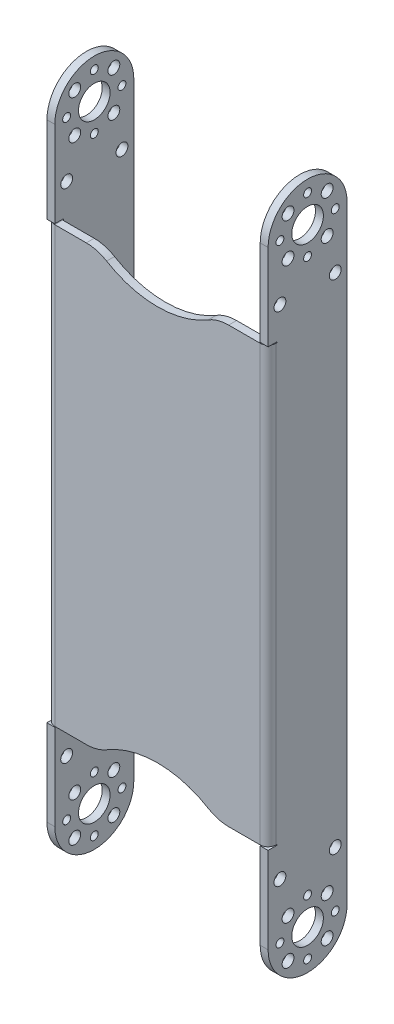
ISO-10303-21;
HEADER;
FILE_DESCRIPTION(('STEP AP214'),'2;1');
FILE_NAME('part.step','',(''),(''),'','','');
FILE_SCHEMA(('AUTOMOTIVE_DESIGN { 1 0 10303 214 1 1 1 1 }'));
ENDSEC;
DATA;
#1=APPLICATION_CONTEXT('core data for automotive mechanical design processes');
#2=APPLICATION_PROTOCOL_DEFINITION('international standard','automotive_design',2000,#1);
#3=PRODUCT_CONTEXT('',#1,'mechanical');
#4=PRODUCT('Part','Part','',(#3));
#5=PRODUCT_RELATED_PRODUCT_CATEGORY('part','',(#4));
#6=PRODUCT_DEFINITION_FORMATION('','',#4);
#7=PRODUCT_DEFINITION_CONTEXT('part definition',#1,'design');
#8=PRODUCT_DEFINITION('design','',#6,#7);
#9=PRODUCT_DEFINITION_SHAPE('','',#8);
#10=(LENGTH_UNIT() NAMED_UNIT(*) SI_UNIT(.MILLI.,.METRE.));
#11=(NAMED_UNIT(*) PLANE_ANGLE_UNIT() SI_UNIT($,.RADIAN.));
#12=(NAMED_UNIT(*) SI_UNIT($,.STERADIAN.) SOLID_ANGLE_UNIT());
#13=UNCERTAINTY_MEASURE_WITH_UNIT(LENGTH_MEASURE(1.E-05),#10,'distance_accuracy_value','');
#14=(GEOMETRIC_REPRESENTATION_CONTEXT(3) GLOBAL_UNCERTAINTY_ASSIGNED_CONTEXT((#13)) GLOBAL_UNIT_ASSIGNED_CONTEXT((#10,
#11,#12)) REPRESENTATION_CONTEXT('',''));
#15=CARTESIAN_POINT('',(0.,0.,0.));
#16=DIRECTION('',(0.,0.,1.));
#17=DIRECTION('',(1.,0.,0.));
#18=AXIS2_PLACEMENT_3D('',#15,#16,#17);
#19=CARTESIAN_POINT('',(44.02775637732,80.,10.));
#20=DIRECTION('',(0.,1.,0.));
#21=DIRECTION('',(0.,0.,1.));
#22=AXIS2_PLACEMENT_3D('',#19,#20,#21);
#23=PLANE('',#22);
#24=DIRECTION('',(1.,0.,0.));
#25=VECTOR('',#24,1.);
#26=CARTESIAN_POINT('',(44.02775637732,80.,8.));
#27=LINE('',#26,#25);
#28=CARTESIAN_POINT('',(44.02775637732,80.0000000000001,8.));
#29=VERTEX_POINT('',#28);
#30=CARTESIAN_POINT('',(52.,80.,8.));
#31=VERTEX_POINT('',#30);
#32=EDGE_CURVE('E801',#29,#31,#27,.T.);
#33=ORIENTED_EDGE('',*,*,#32,.F.);
#34=DIRECTION('',(0.,0.,-1.));
#35=VECTOR('',#34,1.);
#36=CARTESIAN_POINT('',(44.02775637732,80.0000000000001,10.));
#37=LINE('',#36,#35);
#38=CARTESIAN_POINT('',(44.02775637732,80.0000000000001,10.));
#39=VERTEX_POINT('',#38);
#40=EDGE_CURVE('E59',#39,#29,#37,.T.);
#41=ORIENTED_EDGE('',*,*,#40,.F.);
#42=DIRECTION('',(1.,0.,0.));
#43=VECTOR('',#42,1.);
#44=CARTESIAN_POINT('',(44.02775637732,80.,10.));
#45=LINE('',#44,#43);
#46=CARTESIAN_POINT('',(52.,80.,9.99999999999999));
#47=VERTEX_POINT('',#46);
#48=EDGE_CURVE('E784',#39,#47,#45,.T.);
#49=ORIENTED_EDGE('',*,*,#48,.T.);
#50=DIRECTION('',(0.,0.,-1.));
#51=VECTOR('',#50,1.);
#52=CARTESIAN_POINT('',(52.,80.,10.));
#53=LINE('',#52,#51);
#54=EDGE_CURVE('E12',#47,#31,#53,.T.);
#55=ORIENTED_EDGE('',*,*,#54,.T.);
#56=EDGE_LOOP('',(#33,#41,#49,#55));
#57=FACE_BOUND('',#56,.T.);
#58=ADVANCED_FACE('F49',(#57),#23,.T.);
#59=CARTESIAN_POINT('',(44.02775637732,70.,10.));
#60=DIRECTION('',(0.,0.,-1.));
#61=DIRECTION('',(-1.,0.,0.));
#62=AXIS2_PLACEMENT_3D('',#59,#60,#61);
#63=CYLINDRICAL_SURFACE('',#62,10.0000000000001);
#64=CARTESIAN_POINT('',(44.02775637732,70.,8.));
#65=DIRECTION('',(0.,0.,-1.));
#66=DIRECTION('',(-1.,0.,0.));
#67=AXIS2_PLACEMENT_3D('',#64,#65,#66);
#68=CIRCLE('',#67,10.0000000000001);
#69=CARTESIAN_POINT('',(38.876968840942,78.5714285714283,8.));
#70=VERTEX_POINT('',#69);
#71=EDGE_CURVE('E798',#70,#29,#68,.T.);
#72=ORIENTED_EDGE('',*,*,#71,.F.);
#73=DIRECTION('',(0.,0.,-1.));
#74=VECTOR('',#73,1.);
#75=CARTESIAN_POINT('',(38.876968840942,78.5714285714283,10.));
#76=LINE('',#75,#74);
#77=CARTESIAN_POINT('',(38.876968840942,78.5714285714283,10.));
#78=VERTEX_POINT('',#77);
#79=EDGE_CURVE('E806',#78,#70,#76,.T.);
#80=ORIENTED_EDGE('',*,*,#79,.F.);
#81=CARTESIAN_POINT('',(44.02775637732,70.,10.));
#82=DIRECTION('',(0.,0.,-1.));
#83=DIRECTION('',(-1.,0.,0.));
#84=AXIS2_PLACEMENT_3D('',#81,#82,#83);
#85=CIRCLE('',#84,10.0000000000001);
#86=EDGE_CURVE('E782',#78,#39,#85,.T.);
#87=ORIENTED_EDGE('',*,*,#86,.T.);
#88=ORIENTED_EDGE('',*,*,#40,.T.);
#89=EDGE_LOOP('',(#72,#80,#87,#88));
#90=FACE_BOUND('',#89,.T.);
#91=ADVANCED_FACE('F892',(#90),#63,.T.);
#92=CARTESIAN_POINT('',(26.,99.9999999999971,10.));
#93=DIRECTION('',(0.,0.,-1.));
#94=DIRECTION('',(-1.,0.,0.));
#95=AXIS2_PLACEMENT_3D('',#92,#93,#94);
#96=CYLINDRICAL_SURFACE('',#95,24.9999999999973);
#97=CARTESIAN_POINT('',(26.,99.9999999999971,8.));
#98=DIRECTION('',(0.,0.,1.));
#99=DIRECTION('',(1.,0.,0.));
#100=AXIS2_PLACEMENT_3D('',#97,#98,#99);
#101=CIRCLE('',#100,24.9999999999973);
#102=CARTESIAN_POINT('',(13.123031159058,78.5714285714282,8.));
#103=VERTEX_POINT('',#102);
#104=EDGE_CURVE('E795',#103,#70,#101,.T.);
#105=ORIENTED_EDGE('',*,*,#104,.F.);
#106=DIRECTION('',(0.,0.,-1.));
#107=VECTOR('',#106,1.);
#108=CARTESIAN_POINT('',(13.123031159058,78.5714285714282,10.));
#109=LINE('',#108,#107);
#110=CARTESIAN_POINT('',(13.123031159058,78.5714285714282,10.));
#111=VERTEX_POINT('',#110);
#112=EDGE_CURVE('E808',#111,#103,#109,.T.);
#113=ORIENTED_EDGE('',*,*,#112,.F.);
#114=CARTESIAN_POINT('',(26.,99.9999999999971,10.));
#115=DIRECTION('',(0.,0.,1.));
#116=DIRECTION('',(1.,0.,0.));
#117=AXIS2_PLACEMENT_3D('',#114,#115,#116);
#118=CIRCLE('',#117,24.9999999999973);
#119=EDGE_CURVE('E779',#111,#78,#118,.T.);
#120=ORIENTED_EDGE('',*,*,#119,.T.);
#121=ORIENTED_EDGE('',*,*,#79,.T.);
#122=EDGE_LOOP('',(#105,#113,#120,#121));
#123=FACE_BOUND('',#122,.T.);
#124=ADVANCED_FACE('F861',(#123),#96,.F.);
#125=CARTESIAN_POINT('',(7.97224362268,70.,10.));
#126=DIRECTION('',(0.,0.,-1.));
#127=DIRECTION('',(-1.,0.,0.));
#128=AXIS2_PLACEMENT_3D('',#125,#126,#127);
#129=CYLINDRICAL_SURFACE('',#128,10.0000000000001);
#130=CARTESIAN_POINT('',(7.97224362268,70.,8.));
#131=DIRECTION('',(0.,0.,-1.));
#132=DIRECTION('',(-1.,0.,0.));
#133=AXIS2_PLACEMENT_3D('',#130,#131,#132);
#134=CIRCLE('',#133,10.0000000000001);
#135=CARTESIAN_POINT('',(7.97224362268,80.,8.));
#136=VERTEX_POINT('',#135);
#137=EDGE_CURVE('E792',#136,#103,#134,.T.);
#138=ORIENTED_EDGE('',*,*,#137,.F.);
#139=DIRECTION('',(0.,0.,-1.));
#140=VECTOR('',#139,1.);
#141=CARTESIAN_POINT('',(7.97224362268,80.,10.));
#142=LINE('',#141,#140);
#143=CARTESIAN_POINT('',(7.97224362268,80.,10.));
#144=VERTEX_POINT('',#143);
#145=EDGE_CURVE('E99',#144,#136,#142,.T.);
#146=ORIENTED_EDGE('',*,*,#145,.F.);
#147=CARTESIAN_POINT('',(7.97224362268,70.,10.));
#148=DIRECTION('',(0.,0.,-1.));
#149=DIRECTION('',(-1.,0.,0.));
#150=AXIS2_PLACEMENT_3D('',#147,#148,#149);
#151=CIRCLE('',#150,10.0000000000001);
#152=EDGE_CURVE('E777',#144,#111,#151,.T.);
#153=ORIENTED_EDGE('',*,*,#152,.T.);
#154=ORIENTED_EDGE('',*,*,#112,.T.);
#155=EDGE_LOOP('',(#138,#146,#153,#154));
#156=FACE_BOUND('',#155,.T.);
#157=ADVANCED_FACE('F854',(#156),#129,.T.);
#158=CARTESIAN_POINT('',(0.,80.,10.));
#159=DIRECTION('',(0.,1.,0.));
#160=DIRECTION('',(0.,0.,1.));
#161=AXIS2_PLACEMENT_3D('',#158,#159,#160);
#162=PLANE('',#161);
#163=DIRECTION('',(1.,0.,0.));
#164=VECTOR('',#163,1.);
#165=CARTESIAN_POINT('',(0.,80.,8.));
#166=LINE('',#165,#164);
#167=CARTESIAN_POINT('',(0.,80.,8.));
#168=VERTEX_POINT('',#167);
#169=EDGE_CURVE('E789',#168,#136,#166,.T.);
#170=ORIENTED_EDGE('',*,*,#169,.F.);
#171=DIRECTION('',(0.,0.,-1.));
#172=VECTOR('',#171,1.);
#173=CARTESIAN_POINT('',(0.,80.,10.));
#174=LINE('',#173,#172);
#175=CARTESIAN_POINT('',(0.,80.,10.));
#176=VERTEX_POINT('',#175);
#177=EDGE_CURVE('E53',#176,#168,#174,.T.);
#178=ORIENTED_EDGE('',*,*,#177,.F.);
#179=DIRECTION('',(1.,0.,0.));
#180=VECTOR('',#179,1.);
#181=CARTESIAN_POINT('',(0.,80.,10.));
#182=LINE('',#181,#180);
#183=EDGE_CURVE('E773',#176,#144,#182,.T.);
#184=ORIENTED_EDGE('',*,*,#183,.T.);
#185=ORIENTED_EDGE('',*,*,#145,.T.);
#186=EDGE_LOOP('',(#170,#178,#184,#185));
#187=FACE_BOUND('',#186,.T.);
#188=ADVANCED_FACE('F51',(#187),#162,.T.);
#189=CARTESIAN_POINT('',(52.,80.,9.99999999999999));
#190=DIRECTION('',(0.,-1.,0.));
#191=DIRECTION('',(1.,0.,0.));
#192=AXIS2_PLACEMENT_3D('',#189,#190,#191);
#193=PLANE('',#192);
#194=ORIENTED_EDGE('',*,*,#54,.F.);
#195=CARTESIAN_POINT('',(52.,80.,8.));
#196=DIRECTION('',(0.,1.,0.));
#197=DIRECTION('',(-1.,0.,0.));
#198=AXIS2_PLACEMENT_3D('',#195,#196,#197);
#199=CIRCLE('',#198,1.99999999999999);
#200=CARTESIAN_POINT('',(54.,80.,8.00000000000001));
#201=VERTEX_POINT('',#200);
#202=EDGE_CURVE('E768',#47,#201,#199,.T.);
#203=ORIENTED_EDGE('',*,*,#202,.T.);
#204=DIRECTION('',(-1.,0.,0.));
#205=VECTOR('',#204,1.);
#206=CARTESIAN_POINT('',(54.,80.,8.00000000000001));
#207=LINE('',#206,#205);
#208=EDGE_CURVE('E93',#201,#31,#207,.T.);
#209=ORIENTED_EDGE('',*,*,#208,.T.);
#210=EDGE_LOOP('',(#194,#203,#209));
#211=FACE_BOUND('',#210,.T.);
#212=ADVANCED_FACE('F853',(#211),#193,.F.);
#213=CARTESIAN_POINT('',(52.,80.,8.));
#214=DIRECTION('',(0.,1.,0.));
#215=DIRECTION('',(-1.,0.,0.));
#216=AXIS2_PLACEMENT_3D('',#213,#214,#215);
#217=CYLINDRICAL_SURFACE('',#216,1.99999999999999);
#218=DIRECTION('',(0.,-1.,0.));
#219=VECTOR('',#218,1.);
#220=CARTESIAN_POINT('',(52.,80.,10.));
#221=LINE('',#220,#219);
#222=CARTESIAN_POINT('',(52.,-30.,9.99999999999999));
#223=VERTEX_POINT('',#222);
#224=EDGE_CURVE('E786',#47,#223,#221,.T.);
#225=ORIENTED_EDGE('',*,*,#224,.T.);
#226=CARTESIAN_POINT('',(52.,-30.,8.));
#227=DIRECTION('',(0.,1.,0.));
#228=DIRECTION('',(-1.,0.,0.));
#229=AXIS2_PLACEMENT_3D('',#226,#227,#228);
#230=CIRCLE('',#229,1.99999999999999);
#231=CARTESIAN_POINT('',(54.,-30.,8.00000000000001));
#232=VERTEX_POINT('',#231);
#233=EDGE_CURVE('E299',#223,#232,#230,.T.);
#234=ORIENTED_EDGE('',*,*,#233,.T.);
#235=DIRECTION('',(0.,-1.,0.));
#236=VECTOR('',#235,1.);
#237=CARTESIAN_POINT('',(54.,20.,8.00000000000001));
#238=LINE('',#237,#236);
#239=EDGE_CURVE('E725',#201,#232,#238,.T.);
#240=ORIENTED_EDGE('',*,*,#239,.F.);
#241=ORIENTED_EDGE('',*,*,#202,.F.);
#242=EDGE_LOOP('',(#225,#234,#240,#241));
#243=FACE_BOUND('',#242,.T.);
#244=ADVANCED_FACE('F859',(#243),#217,.T.);
#245=CARTESIAN_POINT('',(54.,88.,7.00000000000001));
#246=DIRECTION('',(-1.,0.,0.));
#247=DIRECTION('',(0.,0.,1.));
#248=AXIS2_PLACEMENT_3D('',#245,#246,#247);
#249=CYLINDRICAL_SURFACE('',#248,1.5);
#250=CARTESIAN_POINT('',(54.,88.,7.00000000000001));
#251=DIRECTION('',(1.,0.,0.));
#252=DIRECTION('',(0.,0.,1.));
#253=AXIS2_PLACEMENT_3D('',#250,#251,#252);
#254=CIRCLE('',#253,1.5);
#255=CARTESIAN_POINT('',(54.,88.,8.50000000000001));
#256=VERTEX_POINT('',#255);
#257=EDGE_CURVE('E659',#256,#256,#254,.T.);
#258=ORIENTED_EDGE('',*,*,#257,.T.);
#259=EDGE_LOOP('',(#258));
#260=FACE_BOUND('',#259,.T.);
#261=CARTESIAN_POINT('',(52.,88.,7.));
#262=DIRECTION('',(1.,0.,0.));
#263=DIRECTION('',(0.,0.,1.));
#264=AXIS2_PLACEMENT_3D('',#261,#262,#263);
#265=CIRCLE('',#264,1.5);
#266=CARTESIAN_POINT('',(52.,88.,8.5));
#267=VERTEX_POINT('',#266);
#268=EDGE_CURVE('E658',#267,#267,#265,.T.);
#269=ORIENTED_EDGE('',*,*,#268,.F.);
#270=EDGE_LOOP('',(#269));
#271=FACE_BOUND('',#270,.T.);
#272=ADVANCED_FACE('F882',(#260,#271),#249,.F.);
#273=CARTESIAN_POINT('',(54.,102.,7.00000000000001));
#274=DIRECTION('',(-1.,0.,0.));
#275=DIRECTION('',(0.,0.,1.));
#276=AXIS2_PLACEMENT_3D('',#273,#274,#275);
#277=CYLINDRICAL_SURFACE('',#276,1.);
#278=CARTESIAN_POINT('',(54.,102.,7.00000000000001));
#279=DIRECTION('',(1.,0.,0.));
#280=DIRECTION('',(0.,0.,1.));
#281=AXIS2_PLACEMENT_3D('',#278,#279,#280);
#282=CIRCLE('',#281,1.);
#283=CARTESIAN_POINT('',(54.,102.,8.00000000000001));
#284=VERTEX_POINT('',#283);
#285=EDGE_CURVE('E665',#284,#284,#282,.T.);
#286=ORIENTED_EDGE('',*,*,#285,.T.);
#287=EDGE_LOOP('',(#286));
#288=FACE_BOUND('',#287,.T.);
#289=CARTESIAN_POINT('',(52.,102.,7.));
#290=DIRECTION('',(1.,0.,0.));
#291=DIRECTION('',(0.,0.,1.));
#292=AXIS2_PLACEMENT_3D('',#289,#290,#291);
#293=CIRCLE('',#292,1.);
#294=CARTESIAN_POINT('',(52.,102.,8.));
#295=VERTEX_POINT('',#294);
#296=EDGE_CURVE('E662',#295,#295,#293,.T.);
#297=ORIENTED_EDGE('',*,*,#296,.F.);
#298=EDGE_LOOP('',(#297));
#299=FACE_BOUND('',#298,.T.);
#300=ADVANCED_FACE('F957',(#288,#299),#277,.F.);
#301=CARTESIAN_POINT('',(54.,106.94974746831,4.94974746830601));
#302=DIRECTION('',(-1.,0.,0.));
#303=DIRECTION('',(0.,0.,1.));
#304=AXIS2_PLACEMENT_3D('',#301,#302,#303);
#305=CYLINDRICAL_SURFACE('',#304,1.5);
#306=CARTESIAN_POINT('',(54.,106.94974746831,4.94974746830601));
#307=DIRECTION('',(1.,0.,0.));
#308=DIRECTION('',(0.,0.,1.));
#309=AXIS2_PLACEMENT_3D('',#306,#307,#308);
#310=CIRCLE('',#309,1.5);
#311=CARTESIAN_POINT('',(54.,106.94974746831,6.44974746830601));
#312=VERTEX_POINT('',#311);
#313=EDGE_CURVE('E671',#312,#312,#310,.T.);
#314=ORIENTED_EDGE('',*,*,#313,.T.);
#315=EDGE_LOOP('',(#314));
#316=FACE_BOUND('',#315,.T.);
#317=CARTESIAN_POINT('',(52.,106.94974746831,4.949747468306));
#318=DIRECTION('',(1.,0.,0.));
#319=DIRECTION('',(0.,0.,1.));
#320=AXIS2_PLACEMENT_3D('',#317,#318,#319);
#321=CIRCLE('',#320,1.5);
#322=CARTESIAN_POINT('',(52.,106.94974746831,6.449747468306));
#323=VERTEX_POINT('',#322);
#324=EDGE_CURVE('E668',#323,#323,#321,.T.);
#325=ORIENTED_EDGE('',*,*,#324,.F.);
#326=EDGE_LOOP('',(#325));
#327=FACE_BOUND('',#326,.T.);
#328=ADVANCED_FACE('F961',(#316,#327),#305,.F.);
#329=CARTESIAN_POINT('',(54.,88.,-6.99999999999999));
#330=DIRECTION('',(-1.,0.,0.));
#331=DIRECTION('',(0.,0.,1.));
#332=AXIS2_PLACEMENT_3D('',#329,#330,#331);
#333=CYLINDRICAL_SURFACE('',#332,1.5);
#334=CARTESIAN_POINT('',(54.,88.,-6.99999999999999));
#335=DIRECTION('',(1.,0.,0.));
#336=DIRECTION('',(0.,0.,1.));
#337=AXIS2_PLACEMENT_3D('',#334,#335,#336);
#338=CIRCLE('',#337,1.5);
#339=CARTESIAN_POINT('',(54.,88.,-5.49999999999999));
#340=VERTEX_POINT('',#339);
#341=EDGE_CURVE('E677',#340,#340,#338,.T.);
#342=ORIENTED_EDGE('',*,*,#341,.T.);
#343=EDGE_LOOP('',(#342));
#344=FACE_BOUND('',#343,.T.);
#345=CARTESIAN_POINT('',(52.,88.,-7.));
#346=DIRECTION('',(1.,0.,0.));
#347=DIRECTION('',(0.,0.,1.));
#348=AXIS2_PLACEMENT_3D('',#345,#346,#347);
#349=CIRCLE('',#348,1.5);
#350=CARTESIAN_POINT('',(52.,88.,-5.5));
#351=VERTEX_POINT('',#350);
#352=EDGE_CURVE('E674',#351,#351,#349,.T.);
#353=ORIENTED_EDGE('',*,*,#352,.F.);
#354=EDGE_LOOP('',(#353));
#355=FACE_BOUND('',#354,.T.);
#356=ADVANCED_FACE('F965',(#344,#355),#333,.F.);
#357=CARTESIAN_POINT('',(54.,109.,0.));
#358=DIRECTION('',(-1.,0.,0.));
#359=DIRECTION('',(0.,0.,1.));
#360=AXIS2_PLACEMENT_3D('',#357,#358,#359);
#361=CYLINDRICAL_SURFACE('',#360,1.);
#362=CARTESIAN_POINT('',(54.,109.,0.));
#363=DIRECTION('',(1.,0.,0.));
#364=DIRECTION('',(0.,0.,1.));
#365=AXIS2_PLACEMENT_3D('',#362,#363,#364);
#366=CIRCLE('',#365,1.);
#367=CARTESIAN_POINT('',(54.,109.,1.00000000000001));
#368=VERTEX_POINT('',#367);
#369=EDGE_CURVE('E683',#368,#368,#366,.T.);
#370=ORIENTED_EDGE('',*,*,#369,.T.);
#371=EDGE_LOOP('',(#370));
#372=FACE_BOUND('',#371,.T.);
#373=CARTESIAN_POINT('',(52.,109.,0.));
#374=DIRECTION('',(1.,0.,0.));
#375=DIRECTION('',(0.,0.,1.));
#376=AXIS2_PLACEMENT_3D('',#373,#374,#375);
#377=CIRCLE('',#376,1.);
#378=CARTESIAN_POINT('',(52.,109.,1.));
#379=VERTEX_POINT('',#378);
#380=EDGE_CURVE('E680',#379,#379,#377,.T.);
#381=ORIENTED_EDGE('',*,*,#380,.F.);
#382=EDGE_LOOP('',(#381));
#383=FACE_BOUND('',#382,.T.);
#384=ADVANCED_FACE('F969',(#372,#383),#361,.F.);
#385=CARTESIAN_POINT('',(54.,106.94974746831,-4.94974746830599));
#386=DIRECTION('',(-1.,0.,0.));
#387=DIRECTION('',(0.,0.,1.));
#388=AXIS2_PLACEMENT_3D('',#385,#386,#387);
#389=CYLINDRICAL_SURFACE('',#388,1.5);
#390=CARTESIAN_POINT('',(54.,106.94974746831,-4.94974746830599));
#391=DIRECTION('',(1.,0.,0.));
#392=DIRECTION('',(0.,0.,1.));
#393=AXIS2_PLACEMENT_3D('',#390,#391,#392);
#394=CIRCLE('',#393,1.5);
#395=CARTESIAN_POINT('',(54.,106.94974746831,-3.44974746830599));
#396=VERTEX_POINT('',#395);
#397=EDGE_CURVE('E689',#396,#396,#394,.T.);
#398=ORIENTED_EDGE('',*,*,#397,.T.);
#399=EDGE_LOOP('',(#398));
#400=FACE_BOUND('',#399,.T.);
#401=CARTESIAN_POINT('',(52.,106.94974746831,-4.949747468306));
#402=DIRECTION('',(1.,0.,0.));
#403=DIRECTION('',(0.,0.,1.));
#404=AXIS2_PLACEMENT_3D('',#401,#402,#403);
#405=CIRCLE('',#404,1.5);
#406=CARTESIAN_POINT('',(52.,106.94974746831,-3.449747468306));
#407=VERTEX_POINT('',#406);
#408=EDGE_CURVE('E686',#407,#407,#405,.T.);
#409=ORIENTED_EDGE('',*,*,#408,.F.);
#410=EDGE_LOOP('',(#409));
#411=FACE_BOUND('',#410,.T.);
#412=ADVANCED_FACE('F973',(#400,#411),#389,.F.);
#413=CARTESIAN_POINT('',(54.,97.05025253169,-4.94974746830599));
#414=DIRECTION('',(-1.,0.,0.));
#415=DIRECTION('',(0.,0.,1.));
#416=AXIS2_PLACEMENT_3D('',#413,#414,#415);
#417=CYLINDRICAL_SURFACE('',#416,1.5);
#418=CARTESIAN_POINT('',(54.,97.05025253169,-4.94974746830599));
#419=DIRECTION('',(1.,0.,0.));
#420=DIRECTION('',(0.,0.,1.));
#421=AXIS2_PLACEMENT_3D('',#418,#419,#420);
#422=CIRCLE('',#421,1.5);
#423=CARTESIAN_POINT('',(54.,97.05025253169,-3.44974746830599));
#424=VERTEX_POINT('',#423);
#425=EDGE_CURVE('E695',#424,#424,#422,.T.);
#426=ORIENTED_EDGE('',*,*,#425,.T.);
#427=EDGE_LOOP('',(#426));
#428=FACE_BOUND('',#427,.T.);
#429=CARTESIAN_POINT('',(52.,97.05025253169,-4.949747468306));
#430=DIRECTION('',(1.,0.,0.));
#431=DIRECTION('',(0.,0.,1.));
#432=AXIS2_PLACEMENT_3D('',#429,#430,#431);
#433=CIRCLE('',#432,1.5);
#434=CARTESIAN_POINT('',(52.,97.05025253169,-3.449747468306));
#435=VERTEX_POINT('',#434);
#436=EDGE_CURVE('E692',#435,#435,#433,.T.);
#437=ORIENTED_EDGE('',*,*,#436,.F.);
#438=EDGE_LOOP('',(#437));
#439=FACE_BOUND('',#438,.T.);
#440=ADVANCED_FACE('F977',(#428,#439),#417,.F.);
#441=CARTESIAN_POINT('',(54.,95.,4.53695074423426E-13));
#442=DIRECTION('',(-1.,0.,0.));
#443=DIRECTION('',(0.,0.,1.));
#444=AXIS2_PLACEMENT_3D('',#441,#442,#443);
#445=CYLINDRICAL_SURFACE('',#444,0.999999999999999);
#446=CARTESIAN_POINT('',(54.,95.,4.53695074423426E-13));
#447=DIRECTION('',(1.,0.,0.));
#448=DIRECTION('',(0.,0.,1.));
#449=AXIS2_PLACEMENT_3D('',#446,#447,#448);
#450=CIRCLE('',#449,0.999999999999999);
#451=CARTESIAN_POINT('',(54.,95.,1.00000000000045));
#452=VERTEX_POINT('',#451);
#453=EDGE_CURVE('E701',#452,#452,#450,.T.);
#454=ORIENTED_EDGE('',*,*,#453,.T.);
#455=EDGE_LOOP('',(#454));
#456=FACE_BOUND('',#455,.T.);
#457=CARTESIAN_POINT('',(52.,95.,4.45823933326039E-13));
#458=DIRECTION('',(1.,0.,0.));
#459=DIRECTION('',(0.,0.,1.));
#460=AXIS2_PLACEMENT_3D('',#457,#458,#459);
#461=CIRCLE('',#460,0.999999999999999);
#462=CARTESIAN_POINT('',(52.,95.,1.00000000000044));
#463=VERTEX_POINT('',#462);
#464=EDGE_CURVE('E698',#463,#463,#461,.T.);
#465=ORIENTED_EDGE('',*,*,#464,.F.);
#466=EDGE_LOOP('',(#465));
#467=FACE_BOUND('',#466,.T.);
#468=ADVANCED_FACE('F981',(#456,#467),#445,.F.);
#469=CARTESIAN_POINT('',(54.,97.05025253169,4.94974746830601));
#470=DIRECTION('',(-1.,0.,0.));
#471=DIRECTION('',(0.,0.,1.));
#472=AXIS2_PLACEMENT_3D('',#469,#470,#471);
#473=CYLINDRICAL_SURFACE('',#472,1.5);
#474=CARTESIAN_POINT('',(54.,97.05025253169,4.94974746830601));
#475=DIRECTION('',(1.,0.,0.));
#476=DIRECTION('',(0.,0.,1.));
#477=AXIS2_PLACEMENT_3D('',#474,#475,#476);
#478=CIRCLE('',#477,1.5);
#479=CARTESIAN_POINT('',(54.,97.05025253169,6.44974746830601));
#480=VERTEX_POINT('',#479);
#481=EDGE_CURVE('E707',#480,#480,#478,.T.);
#482=ORIENTED_EDGE('',*,*,#481,.T.);
#483=EDGE_LOOP('',(#482));
#484=FACE_BOUND('',#483,.T.);
#485=CARTESIAN_POINT('',(52.,97.05025253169,4.949747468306));
#486=DIRECTION('',(1.,0.,0.));
#487=DIRECTION('',(0.,0.,1.));
#488=AXIS2_PLACEMENT_3D('',#485,#486,#487);
#489=CIRCLE('',#488,1.5);
#490=CARTESIAN_POINT('',(52.,97.05025253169,6.449747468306));
#491=VERTEX_POINT('',#490);
#492=EDGE_CURVE('E704',#491,#491,#489,.T.);
#493=ORIENTED_EDGE('',*,*,#492,.F.);
#494=EDGE_LOOP('',(#493));
#495=FACE_BOUND('',#494,.T.);
#496=ADVANCED_FACE('F985',(#484,#495),#473,.F.);
#497=CARTESIAN_POINT('',(54.,102.,-6.99999999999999));
#498=DIRECTION('',(-1.,0.,0.));
#499=DIRECTION('',(0.,0.,1.));
#500=AXIS2_PLACEMENT_3D('',#497,#498,#499);
#501=CYLINDRICAL_SURFACE('',#500,1.);
#502=CARTESIAN_POINT('',(54.,102.,-6.99999999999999));
#503=DIRECTION('',(1.,0.,0.));
#504=DIRECTION('',(0.,0.,1.));
#505=AXIS2_PLACEMENT_3D('',#502,#503,#504);
#506=CIRCLE('',#505,1.);
#507=CARTESIAN_POINT('',(54.,102.,-5.99999999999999));
#508=VERTEX_POINT('',#507);
#509=EDGE_CURVE('E713',#508,#508,#506,.T.);
#510=ORIENTED_EDGE('',*,*,#509,.T.);
#511=EDGE_LOOP('',(#510));
#512=FACE_BOUND('',#511,.T.);
#513=CARTESIAN_POINT('',(52.,102.,-7.));
#514=DIRECTION('',(1.,0.,0.));
#515=DIRECTION('',(0.,0.,1.));
#516=AXIS2_PLACEMENT_3D('',#513,#514,#515);
#517=CIRCLE('',#516,1.);
#518=CARTESIAN_POINT('',(52.,102.,-6.));
#519=VERTEX_POINT('',#518);
#520=EDGE_CURVE('E710',#519,#519,#517,.T.);
#521=ORIENTED_EDGE('',*,*,#520,.F.);
#522=EDGE_LOOP('',(#521));
#523=FACE_BOUND('',#522,.T.);
#524=ADVANCED_FACE('F989',(#512,#523),#501,.F.);
#525=CARTESIAN_POINT('',(54.,102.,3.51346389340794E-13));
#526=DIRECTION('',(-1.,0.,0.));
#527=DIRECTION('',(0.,0.,1.));
#528=AXIS2_PLACEMENT_3D('',#525,#526,#527);
#529=CYLINDRICAL_SURFACE('',#528,4.00000000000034);
#530=CARTESIAN_POINT('',(54.,102.,3.51346389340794E-13));
#531=DIRECTION('',(1.,0.,0.));
#532=DIRECTION('',(0.,0.,1.));
#533=AXIS2_PLACEMENT_3D('',#530,#531,#532);
#534=CIRCLE('',#533,4.00000000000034);
#535=CARTESIAN_POINT('',(54.,102.,4.00000000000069));
#536=VERTEX_POINT('',#535);
#537=EDGE_CURVE('E719',#536,#536,#534,.T.);
#538=ORIENTED_EDGE('',*,*,#537,.T.);
#539=EDGE_LOOP('',(#538));
#540=FACE_BOUND('',#539,.T.);
#541=CARTESIAN_POINT('',(52.,102.,3.43475248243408E-13));
#542=DIRECTION('',(1.,0.,0.));
#543=DIRECTION('',(0.,0.,1.));
#544=AXIS2_PLACEMENT_3D('',#541,#542,#543);
#545=CIRCLE('',#544,4.00000000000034);
#546=CARTESIAN_POINT('',(52.,102.,4.00000000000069));
#547=VERTEX_POINT('',#546);
#548=EDGE_CURVE('E716',#547,#547,#545,.T.);
#549=ORIENTED_EDGE('',*,*,#548,.F.);
#550=EDGE_LOOP('',(#549));
#551=FACE_BOUND('',#550,.T.);
#552=ADVANCED_FACE('F993',(#540,#551),#529,.F.);
#553=CARTESIAN_POINT('',(54.,80.2,10.));
#554=DIRECTION('',(0.,0.,-1.));
#555=DIRECTION('',(-1.,0.,0.));
#556=AXIS2_PLACEMENT_3D('',#553,#554,#555);
#557=PLANE('',#556);
#558=DIRECTION('',(0.,-1.,0.));
#559=VECTOR('',#558,1.);
#560=CARTESIAN_POINT('',(52.,80.2,10.));
#561=LINE('',#560,#559);
#562=CARTESIAN_POINT('',(52.,102.,10.));
#563=VERTEX_POINT('',#562);
#564=CARTESIAN_POINT('',(52.,80.2,10.));
#565=VERTEX_POINT('',#564);
#566=EDGE_CURVE('E744',#563,#565,#561,.T.);
#567=ORIENTED_EDGE('',*,*,#566,.T.);
#568=DIRECTION('',(-1.,0.,0.));
#569=VECTOR('',#568,1.);
#570=CARTESIAN_POINT('',(54.,80.2,10.));
#571=LINE('',#570,#569);
#572=CARTESIAN_POINT('',(54.,80.2,10.));
#573=VERTEX_POINT('',#572);
#574=EDGE_CURVE('E759',#573,#565,#571,.T.);
#575=ORIENTED_EDGE('',*,*,#574,.F.);
#576=DIRECTION('',(0.,-1.,0.));
#577=VECTOR('',#576,1.);
#578=CARTESIAN_POINT('',(54.,80.2,10.));
#579=LINE('',#578,#577);
#580=CARTESIAN_POINT('',(54.,102.,10.));
#581=VERTEX_POINT('',#580);
#582=EDGE_CURVE('E732',#581,#573,#579,.T.);
#583=ORIENTED_EDGE('',*,*,#582,.F.);
#584=DIRECTION('',(-1.,0.,0.));
#585=VECTOR('',#584,1.);
#586=CARTESIAN_POINT('',(54.,102.,10.));
#587=LINE('',#586,#585);
#588=EDGE_CURVE('E762',#581,#563,#587,.T.);
#589=ORIENTED_EDGE('',*,*,#588,.T.);
#590=EDGE_LOOP('',(#567,#575,#583,#589));
#591=FACE_BOUND('',#590,.T.);
#592=ADVANCED_FACE('F996',(#591),#557,.F.);
#593=CARTESIAN_POINT('',(54.,80.2,7.80000000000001));
#594=DIRECTION('',(0.,1.,0.));
#595=DIRECTION('',(-1.,0.,0.));
#596=AXIS2_PLACEMENT_3D('',#593,#594,#595);
#597=PLANE('',#596);
#598=DIRECTION('',(0.,0.,-1.));
#599=VECTOR('',#598,1.);
#600=CARTESIAN_POINT('',(52.,80.2,7.8));
#601=LINE('',#600,#599);
#602=CARTESIAN_POINT('',(52.,80.2,7.8));
#603=VERTEX_POINT('',#602);
#604=EDGE_CURVE('E746',#565,#603,#601,.T.);
#605=ORIENTED_EDGE('',*,*,#604,.T.);
#606=DIRECTION('',(-1.,0.,0.));
#607=VECTOR('',#606,1.);
#608=CARTESIAN_POINT('',(54.,80.2,7.80000000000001));
#609=LINE('',#608,#607);
#610=CARTESIAN_POINT('',(54.,80.2,7.80000000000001));
#611=VERTEX_POINT('',#610);
#612=EDGE_CURVE('E756',#611,#603,#609,.T.);
#613=ORIENTED_EDGE('',*,*,#612,.F.);
#614=DIRECTION('',(0.,0.,-1.));
#615=VECTOR('',#614,1.);
#616=CARTESIAN_POINT('',(54.,80.2,7.80000000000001));
#617=LINE('',#616,#615);
#618=EDGE_CURVE('E734',#573,#611,#617,.T.);
#619=ORIENTED_EDGE('',*,*,#618,.F.);
#620=ORIENTED_EDGE('',*,*,#574,.T.);
#621=EDGE_LOOP('',(#605,#613,#619,#620));
#622=FACE_BOUND('',#621,.T.);
#623=ADVANCED_FACE('F1008',(#622),#597,.F.);
#624=CARTESIAN_POINT('',(54.,80.,7.80000000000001));
#625=DIRECTION('',(0.,0.,-1.));
#626=DIRECTION('',(-1.,0.,0.));
#627=AXIS2_PLACEMENT_3D('',#624,#625,#626);
#628=PLANE('',#627);
#629=DIRECTION('',(0.,-1.,0.));
#630=VECTOR('',#629,1.);
#631=CARTESIAN_POINT('',(52.,80.,7.8));
#632=LINE('',#631,#630);
#633=CARTESIAN_POINT('',(52.,80.,7.8));
#634=VERTEX_POINT('',#633);
#635=EDGE_CURVE('E748',#603,#634,#632,.T.);
#636=ORIENTED_EDGE('',*,*,#635,.T.);
#637=DIRECTION('',(-1.,0.,0.));
#638=VECTOR('',#637,1.);
#639=CARTESIAN_POINT('',(54.,80.,7.80000000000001));
#640=LINE('',#639,#638);
#641=CARTESIAN_POINT('',(54.,80.,7.80000000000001));
#642=VERTEX_POINT('',#641);
#643=EDGE_CURVE('E753',#642,#634,#640,.T.);
#644=ORIENTED_EDGE('',*,*,#643,.F.);
#645=DIRECTION('',(0.,-1.,0.));
#646=VECTOR('',#645,1.);
#647=CARTESIAN_POINT('',(54.,80.,7.80000000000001));
#648=LINE('',#647,#646);
#649=EDGE_CURVE('E736',#611,#642,#648,.T.);
#650=ORIENTED_EDGE('',*,*,#649,.F.);
#651=ORIENTED_EDGE('',*,*,#612,.T.);
#652=EDGE_LOOP('',(#636,#644,#650,#651));
#653=FACE_BOUND('',#652,.T.);
#654=ADVANCED_FACE('F1004',(#653),#628,.F.);
#655=CARTESIAN_POINT('',(54.,80.,8.00000000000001));
#656=DIRECTION('',(0.,-1.,0.));
#657=DIRECTION('',(1.,0.,0.));
#658=AXIS2_PLACEMENT_3D('',#655,#656,#657);
#659=PLANE('',#658);
#660=DIRECTION('',(0.,0.,1.));
#661=VECTOR('',#660,1.);
#662=CARTESIAN_POINT('',(52.,80.,8.));
#663=LINE('',#662,#661);
#664=EDGE_CURVE('E728',#634,#31,#663,.T.);
#665=ORIENTED_EDGE('',*,*,#664,.T.);
#666=ORIENTED_EDGE('',*,*,#208,.F.);
#667=DIRECTION('',(0.,0.,1.));
#668=VECTOR('',#667,1.);
#669=CARTESIAN_POINT('',(54.,80.,8.00000000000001));
#670=LINE('',#669,#668);
#671=EDGE_CURVE('E738',#642,#201,#670,.T.);
#672=ORIENTED_EDGE('',*,*,#671,.F.);
#673=ORIENTED_EDGE('',*,*,#643,.T.);
#674=EDGE_LOOP('',(#665,#666,#672,#673));
#675=FACE_BOUND('',#674,.T.);
#676=ADVANCED_FACE('F954',(#675),#659,.F.);
#677=CARTESIAN_POINT('',(0.,80.,10.));
#678=DIRECTION('',(0.,1.,0.));
#679=DIRECTION('',(-1.,0.,0.));
#680=AXIS2_PLACEMENT_3D('',#677,#678,#679);
#681=PLANE('',#680);
#682=CARTESIAN_POINT('',(0.,80.,8.));
#683=DIRECTION('',(0.,-1.,0.));
#684=DIRECTION('',(1.,0.,0.));
#685=AXIS2_PLACEMENT_3D('',#682,#683,#684);
#686=CIRCLE('',#685,2.);
#687=CARTESIAN_POINT('',(-2.,80.,8.00000000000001));
#688=VERTEX_POINT('',#687);
#689=EDGE_CURVE('E655',#176,#688,#686,.T.);
#690=ORIENTED_EDGE('',*,*,#689,.F.);
#691=ORIENTED_EDGE('',*,*,#177,.T.);
#692=DIRECTION('',(1.,0.,0.));
#693=VECTOR('',#692,1.);
#694=CARTESIAN_POINT('',(-2.,80.,8.00000000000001));
#695=LINE('',#694,#693);
#696=EDGE_CURVE('E652',#688,#168,#695,.T.);
#697=ORIENTED_EDGE('',*,*,#696,.F.);
#698=EDGE_LOOP('',(#690,#691,#697));
#699=FACE_BOUND('',#698,.T.);
#700=ADVANCED_FACE('F816',(#699),#681,.T.);
#701=CARTESIAN_POINT('',(26.,2.92821322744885E-12,10.));
#702=DIRECTION('',(0.,0.,1.));
#703=DIRECTION('',(1.,0.,0.));
#704=AXIS2_PLACEMENT_3D('',#701,#702,#703);
#705=PLANE('',#704);
#706=ORIENTED_EDGE('',*,*,#183,.F.);
#707=DIRECTION('',(0.,1.,0.));
#708=VECTOR('',#707,1.);
#709=CARTESIAN_POINT('',(0.,20.,10.));
#710=LINE('',#709,#708);
#711=CARTESIAN_POINT('',(0.,-30.,10.));
#712=VERTEX_POINT('',#711);
#713=EDGE_CURVE('E771',#712,#176,#710,.T.);
#714=ORIENTED_EDGE('',*,*,#713,.F.);
#715=DIRECTION('',(-1.,0.,0.));
#716=VECTOR('',#715,1.);
#717=CARTESIAN_POINT('',(7.97224362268,-30.,10.));
#718=LINE('',#717,#716);
#719=CARTESIAN_POINT('',(7.97224362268,-30.0000000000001,10.));
#720=VERTEX_POINT('',#719);
#721=EDGE_CURVE('E321',#720,#712,#718,.T.);
#722=ORIENTED_EDGE('',*,*,#721,.F.);
#723=CARTESIAN_POINT('',(7.97224362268,-20.,10.));
#724=DIRECTION('',(0.,0.,-1.));
#725=DIRECTION('',(-1.,0.,0.));
#726=AXIS2_PLACEMENT_3D('',#723,#724,#725);
#727=CIRCLE('',#726,10.0000000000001);
#728=CARTESIAN_POINT('',(13.123031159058,-28.5714285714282,10.));
#729=VERTEX_POINT('',#728);
#730=EDGE_CURVE('E310',#729,#720,#727,.T.);
#731=ORIENTED_EDGE('',*,*,#730,.F.);
#732=CARTESIAN_POINT('',(26.,-49.9999999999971,10.));
#733=DIRECTION('',(0.,0.,1.));
#734=DIRECTION('',(1.,0.,0.));
#735=AXIS2_PLACEMENT_3D('',#732,#733,#734);
#736=CIRCLE('',#735,24.9999999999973);
#737=CARTESIAN_POINT('',(38.876968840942,-28.5714285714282,10.));
#738=VERTEX_POINT('',#737);
#739=EDGE_CURVE('E306',#738,#729,#736,.T.);
#740=ORIENTED_EDGE('',*,*,#739,.F.);
#741=CARTESIAN_POINT('',(44.02775637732,-20.,10.));
#742=DIRECTION('',(0.,0.,-1.));
#743=DIRECTION('',(-1.,0.,0.));
#744=AXIS2_PLACEMENT_3D('',#741,#742,#743);
#745=CIRCLE('',#744,10.0000000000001);
#746=CARTESIAN_POINT('',(44.02775637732,-30.,10.));
#747=VERTEX_POINT('',#746);
#748=EDGE_CURVE('E286',#747,#738,#745,.T.);
#749=ORIENTED_EDGE('',*,*,#748,.F.);
#750=DIRECTION('',(-1.,0.,0.));
#751=VECTOR('',#750,1.);
#752=CARTESIAN_POINT('',(52.,-30.,10.));
#753=LINE('',#752,#751);
#754=EDGE_CURVE('E318',#223,#747,#753,.T.);
#755=ORIENTED_EDGE('',*,*,#754,.F.);
#756=ORIENTED_EDGE('',*,*,#224,.F.);
#757=ORIENTED_EDGE('',*,*,#48,.F.);
#758=ORIENTED_EDGE('',*,*,#86,.F.);
#759=ORIENTED_EDGE('',*,*,#119,.F.);
#760=ORIENTED_EDGE('',*,*,#152,.F.);
#761=EDGE_LOOP('',(#706,#714,#722,#731,#740,#749,#755,#756,#757,#758,#759,#760));
#762=FACE_BOUND('',#761,.T.);
#763=ADVANCED_FACE('F849',(#762),#705,.T.);
#764=CARTESIAN_POINT('',(0.,20.,8.));
#765=DIRECTION('',(0.,-1.,0.));
#766=DIRECTION('',(1.,0.,0.));
#767=AXIS2_PLACEMENT_3D('',#764,#765,#766);
#768=CYLINDRICAL_SURFACE('',#767,2.);
#769=ORIENTED_EDGE('',*,*,#689,.T.);
#770=DIRECTION('',(0.,1.,0.));
#771=VECTOR('',#770,1.);
#772=CARTESIAN_POINT('',(-2.,80.,8.00000000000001));
#773=LINE('',#772,#771);
#774=CARTESIAN_POINT('',(-2.00000000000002,-30.,8.00000000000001));
#775=VERTEX_POINT('',#774);
#776=EDGE_CURVE('E612',#775,#688,#773,.T.);
#777=ORIENTED_EDGE('',*,*,#776,.F.);
#778=CARTESIAN_POINT('',(0.,-30.,8.));
#779=DIRECTION('',(0.,-1.,0.));
#780=DIRECTION('',(1.,0.,0.));
#781=AXIS2_PLACEMENT_3D('',#778,#779,#780);
#782=CIRCLE('',#781,2.);
#783=EDGE_CURVE('E432',#712,#775,#782,.T.);
#784=ORIENTED_EDGE('',*,*,#783,.F.);
#785=ORIENTED_EDGE('',*,*,#713,.T.);
#786=EDGE_LOOP('',(#769,#777,#784,#785));
#787=FACE_BOUND('',#786,.T.);
#788=ADVANCED_FACE('F845',(#787),#768,.T.);
#789=CARTESIAN_POINT('',(-2.,88.,7.00000000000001));
#790=DIRECTION('',(1.,0.,0.));
#791=DIRECTION('',(0.,0.,-1.));
#792=AXIS2_PLACEMENT_3D('',#789,#790,#791);
#793=CYLINDRICAL_SURFACE('',#792,1.5);
#794=CARTESIAN_POINT('',(-2.,88.,7.00000000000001));
#795=DIRECTION('',(-1.,0.,0.));
#796=DIRECTION('',(0.,0.,-1.));
#797=AXIS2_PLACEMENT_3D('',#794,#795,#796);
#798=CIRCLE('',#797,1.5);
#799=CARTESIAN_POINT('',(-2.00000000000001,88.,5.50000000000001));
#800=VERTEX_POINT('',#799);
#801=EDGE_CURVE('E546',#800,#800,#798,.T.);
#802=ORIENTED_EDGE('',*,*,#801,.T.);
#803=EDGE_LOOP('',(#802));
#804=FACE_BOUND('',#803,.T.);
#805=CARTESIAN_POINT('',(0.,88.,7.));
#806=DIRECTION('',(-1.,0.,0.));
#807=DIRECTION('',(0.,0.,-1.));
#808=AXIS2_PLACEMENT_3D('',#805,#806,#807);
#809=CIRCLE('',#808,1.5);
#810=CARTESIAN_POINT('',(0.,88.,5.5));
#811=VERTEX_POINT('',#810);
#812=EDGE_CURVE('E543',#811,#811,#809,.T.);
#813=ORIENTED_EDGE('',*,*,#812,.F.);
#814=EDGE_LOOP('',(#813));
#815=FACE_BOUND('',#814,.T.);
#816=ADVANCED_FACE('F951',(#804,#815),#793,.F.);
#817=CARTESIAN_POINT('',(-2.,102.,7.00000000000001));
#818=DIRECTION('',(1.,0.,0.));
#819=DIRECTION('',(0.,0.,-1.));
#820=AXIS2_PLACEMENT_3D('',#817,#818,#819);
#821=CYLINDRICAL_SURFACE('',#820,1.);
#822=CARTESIAN_POINT('',(-2.,102.,7.00000000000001));
#823=DIRECTION('',(-1.,0.,0.));
#824=DIRECTION('',(0.,0.,-1.));
#825=AXIS2_PLACEMENT_3D('',#822,#823,#824);
#826=CIRCLE('',#825,1.);
#827=CARTESIAN_POINT('',(-2.,102.,6.00000000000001));
#828=VERTEX_POINT('',#827);
#829=EDGE_CURVE('E552',#828,#828,#826,.T.);
#830=ORIENTED_EDGE('',*,*,#829,.T.);
#831=EDGE_LOOP('',(#830));
#832=FACE_BOUND('',#831,.T.);
#833=CARTESIAN_POINT('',(0.,102.,7.));
#834=DIRECTION('',(-1.,0.,0.));
#835=DIRECTION('',(0.,0.,-1.));
#836=AXIS2_PLACEMENT_3D('',#833,#834,#835);
#837=CIRCLE('',#836,1.);
#838=CARTESIAN_POINT('',(0.,102.,6.));
#839=VERTEX_POINT('',#838);
#840=EDGE_CURVE('E549',#839,#839,#837,.T.);
#841=ORIENTED_EDGE('',*,*,#840,.F.);
#842=EDGE_LOOP('',(#841));
#843=FACE_BOUND('',#842,.T.);
#844=ADVANCED_FACE('F1148',(#832,#843),#821,.F.);
#845=CARTESIAN_POINT('',(-2.,106.94974746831,4.94974746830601));
#846=DIRECTION('',(1.,0.,0.));
#847=DIRECTION('',(0.,0.,-1.));
#848=AXIS2_PLACEMENT_3D('',#845,#846,#847);
#849=CYLINDRICAL_SURFACE('',#848,1.5);
#850=CARTESIAN_POINT('',(-2.,106.94974746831,4.94974746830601));
#851=DIRECTION('',(-1.,0.,0.));
#852=DIRECTION('',(0.,0.,-1.));
#853=AXIS2_PLACEMENT_3D('',#850,#851,#852);
#854=CIRCLE('',#853,1.5);
#855=CARTESIAN_POINT('',(-2.00000000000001,106.94974746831,3.44974746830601));
#856=VERTEX_POINT('',#855);
#857=EDGE_CURVE('E558',#856,#856,#854,.T.);
#858=ORIENTED_EDGE('',*,*,#857,.T.);
#859=EDGE_LOOP('',(#858));
#860=FACE_BOUND('',#859,.T.);
#861=CARTESIAN_POINT('',(0.,106.94974746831,4.949747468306));
#862=DIRECTION('',(-1.,0.,0.));
#863=DIRECTION('',(0.,0.,-1.));
#864=AXIS2_PLACEMENT_3D('',#861,#862,#863);
#865=CIRCLE('',#864,1.5);
#866=CARTESIAN_POINT('',(0.,106.94974746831,3.449747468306));
#867=VERTEX_POINT('',#866);
#868=EDGE_CURVE('E555',#867,#867,#865,.T.);
#869=ORIENTED_EDGE('',*,*,#868,.F.);
#870=EDGE_LOOP('',(#869));
#871=FACE_BOUND('',#870,.T.);
#872=ADVANCED_FACE('F1152',(#860,#871),#849,.F.);
#873=CARTESIAN_POINT('',(-2.00000000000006,88.,-6.99999999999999));
#874=DIRECTION('',(1.,0.,0.));
#875=DIRECTION('',(0.,0.,-1.));
#876=AXIS2_PLACEMENT_3D('',#873,#874,#875);
#877=CYLINDRICAL_SURFACE('',#876,1.5);
#878=CARTESIAN_POINT('',(-2.00000000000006,88.,-6.99999999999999));
#879=DIRECTION('',(-1.,0.,0.));
#880=DIRECTION('',(0.,0.,-1.));
#881=AXIS2_PLACEMENT_3D('',#878,#879,#880);
#882=CIRCLE('',#881,1.5);
#883=CARTESIAN_POINT('',(-2.00000000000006,88.,-8.49999999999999));
#884=VERTEX_POINT('',#883);
#885=EDGE_CURVE('E564',#884,#884,#882,.T.);
#886=ORIENTED_EDGE('',*,*,#885,.T.);
#887=EDGE_LOOP('',(#886));
#888=FACE_BOUND('',#887,.T.);
#889=CARTESIAN_POINT('',(0.,88.,-7.));
#890=DIRECTION('',(-1.,0.,0.));
#891=DIRECTION('',(0.,0.,-1.));
#892=AXIS2_PLACEMENT_3D('',#889,#890,#891);
#893=CIRCLE('',#892,1.5);
#894=CARTESIAN_POINT('',(0.,88.,-8.5));
#895=VERTEX_POINT('',#894);
#896=EDGE_CURVE('E561',#895,#895,#893,.T.);
#897=ORIENTED_EDGE('',*,*,#896,.F.);
#898=EDGE_LOOP('',(#897));
#899=FACE_BOUND('',#898,.T.);
#900=ADVANCED_FACE('F1156',(#888,#899),#877,.F.);
#901=CARTESIAN_POINT('',(-2.00000000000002,109.,0.));
#902=DIRECTION('',(1.,0.,0.));
#903=DIRECTION('',(0.,0.,-1.));
#904=AXIS2_PLACEMENT_3D('',#901,#902,#903);
#905=CYLINDRICAL_SURFACE('',#904,1.);
#906=CARTESIAN_POINT('',(-2.00000000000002,109.,0.));
#907=DIRECTION('',(-1.,0.,0.));
#908=DIRECTION('',(0.,0.,-1.));
#909=AXIS2_PLACEMENT_3D('',#906,#907,#908);
#910=CIRCLE('',#909,1.);
#911=CARTESIAN_POINT('',(-2.00000000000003,109.,-0.999999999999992));
#912=VERTEX_POINT('',#911);
#913=EDGE_CURVE('E570',#912,#912,#910,.T.);
#914=ORIENTED_EDGE('',*,*,#913,.T.);
#915=EDGE_LOOP('',(#914));
#916=FACE_BOUND('',#915,.T.);
#917=CARTESIAN_POINT('',(0.,109.,0.));
#918=DIRECTION('',(-1.,0.,0.));
#919=DIRECTION('',(0.,0.,-1.));
#920=AXIS2_PLACEMENT_3D('',#917,#918,#919);
#921=CIRCLE('',#920,1.);
#922=CARTESIAN_POINT('',(0.,109.,-1.));
#923=VERTEX_POINT('',#922);
#924=EDGE_CURVE('E567',#923,#923,#921,.T.);
#925=ORIENTED_EDGE('',*,*,#924,.F.);
#926=EDGE_LOOP('',(#925));
#927=FACE_BOUND('',#926,.T.);
#928=ADVANCED_FACE('F1160',(#916,#927),#905,.F.);
#929=CARTESIAN_POINT('',(-2.00000000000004,106.94974746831,-4.94974746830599));
#930=DIRECTION('',(1.,0.,0.));
#931=DIRECTION('',(0.,0.,-1.));
#932=AXIS2_PLACEMENT_3D('',#929,#930,#931);
#933=CYLINDRICAL_SURFACE('',#932,1.5);
#934=CARTESIAN_POINT('',(-2.00000000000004,106.94974746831,-4.94974746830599));
#935=DIRECTION('',(-1.,0.,0.));
#936=DIRECTION('',(0.,0.,-1.));
#937=AXIS2_PLACEMENT_3D('',#934,#935,#936);
#938=CIRCLE('',#937,1.5);
#939=CARTESIAN_POINT('',(-2.00000000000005,106.94974746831,-6.44974746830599));
#940=VERTEX_POINT('',#939);
#941=EDGE_CURVE('E576',#940,#940,#938,.T.);
#942=ORIENTED_EDGE('',*,*,#941,.T.);
#943=EDGE_LOOP('',(#942));
#944=FACE_BOUND('',#943,.T.);
#945=CARTESIAN_POINT('',(0.,106.94974746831,-4.949747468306));
#946=DIRECTION('',(-1.,0.,0.));
#947=DIRECTION('',(0.,0.,-1.));
#948=AXIS2_PLACEMENT_3D('',#945,#946,#947);
#949=CIRCLE('',#948,1.5);
#950=CARTESIAN_POINT('',(0.,106.94974746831,-6.449747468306));
#951=VERTEX_POINT('',#950);
#952=EDGE_CURVE('E573',#951,#951,#949,.T.);
#953=ORIENTED_EDGE('',*,*,#952,.F.);
#954=EDGE_LOOP('',(#953));
#955=FACE_BOUND('',#954,.T.);
#956=ADVANCED_FACE('F1164',(#944,#955),#933,.F.);
#957=CARTESIAN_POINT('',(-2.00000000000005,97.05025253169,-4.94974746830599));
#958=DIRECTION('',(1.,0.,0.));
#959=DIRECTION('',(0.,0.,-1.));
#960=AXIS2_PLACEMENT_3D('',#957,#958,#959);
#961=CYLINDRICAL_SURFACE('',#960,1.5);
#962=CARTESIAN_POINT('',(-2.00000000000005,97.05025253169,-4.94974746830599));
#963=DIRECTION('',(-1.,0.,0.));
#964=DIRECTION('',(0.,0.,-1.));
#965=AXIS2_PLACEMENT_3D('',#962,#963,#964);
#966=CIRCLE('',#965,1.5);
#967=CARTESIAN_POINT('',(-2.00000000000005,97.05025253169,-6.44974746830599));
#968=VERTEX_POINT('',#967);
#969=EDGE_CURVE('E582',#968,#968,#966,.T.);
#970=ORIENTED_EDGE('',*,*,#969,.T.);
#971=EDGE_LOOP('',(#970));
#972=FACE_BOUND('',#971,.T.);
#973=CARTESIAN_POINT('',(0.,97.05025253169,-4.949747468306));
#974=DIRECTION('',(-1.,0.,0.));
#975=DIRECTION('',(0.,0.,-1.));
#976=AXIS2_PLACEMENT_3D('',#973,#974,#975);
#977=CIRCLE('',#976,1.5);
#978=CARTESIAN_POINT('',(0.,97.05025253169,-6.449747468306));
#979=VERTEX_POINT('',#978);
#980=EDGE_CURVE('E579',#979,#979,#977,.T.);
#981=ORIENTED_EDGE('',*,*,#980,.F.);
#982=EDGE_LOOP('',(#981));
#983=FACE_BOUND('',#982,.T.);
#984=ADVANCED_FACE('F1168',(#972,#983),#961,.F.);
#985=CARTESIAN_POINT('',(-2.00000000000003,95.,4.53695074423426E-13));
#986=DIRECTION('',(1.,0.,0.));
#987=DIRECTION('',(0.,0.,-1.));
#988=AXIS2_PLACEMENT_3D('',#985,#986,#987);
#989=CYLINDRICAL_SURFACE('',#988,1.);
#990=CARTESIAN_POINT('',(-2.00000000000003,95.,4.53695074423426E-13));
#991=DIRECTION('',(-1.,0.,0.));
#992=DIRECTION('',(0.,0.,-1.));
#993=AXIS2_PLACEMENT_3D('',#990,#991,#992);
#994=CIRCLE('',#993,1.);
#995=CARTESIAN_POINT('',(-2.00000000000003,95.,-0.999999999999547));
#996=VERTEX_POINT('',#995);
#997=EDGE_CURVE('E588',#996,#996,#994,.T.);
#998=ORIENTED_EDGE('',*,*,#997,.T.);
#999=EDGE_LOOP('',(#998));
#1000=FACE_BOUND('',#999,.T.);
#1001=CARTESIAN_POINT('',(0.,95.,4.45823933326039E-13));
#1002=DIRECTION('',(-1.,0.,0.));
#1003=DIRECTION('',(0.,0.,-1.));
#1004=AXIS2_PLACEMENT_3D('',#1001,#1002,#1003);
#1005=CIRCLE('',#1004,1.);
#1006=CARTESIAN_POINT('',(0.,95.,-0.999999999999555));
#1007=VERTEX_POINT('',#1006);
#1008=EDGE_CURVE('E585',#1007,#1007,#1005,.T.);
#1009=ORIENTED_EDGE('',*,*,#1008,.F.);
#1010=EDGE_LOOP('',(#1009));
#1011=FACE_BOUND('',#1010,.T.);
#1012=ADVANCED_FACE('F1172',(#1000,#1011),#989,.F.);
#1013=CARTESIAN_POINT('',(-2.00000000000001,97.05025253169,4.94974746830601));
#1014=DIRECTION('',(1.,0.,0.));
#1015=DIRECTION('',(0.,0.,-1.));
#1016=AXIS2_PLACEMENT_3D('',#1013,#1014,#1015);
#1017=CYLINDRICAL_SURFACE('',#1016,1.5);
#1018=CARTESIAN_POINT('',(-2.00000000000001,97.05025253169,4.94974746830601));
#1019=DIRECTION('',(-1.,0.,0.));
#1020=DIRECTION('',(0.,0.,-1.));
#1021=AXIS2_PLACEMENT_3D('',#1018,#1019,#1020);
#1022=CIRCLE('',#1021,1.5);
#1023=CARTESIAN_POINT('',(-2.00000000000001,97.05025253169,3.44974746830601));
#1024=VERTEX_POINT('',#1023);
#1025=EDGE_CURVE('E594',#1024,#1024,#1022,.T.);
#1026=ORIENTED_EDGE('',*,*,#1025,.T.);
#1027=EDGE_LOOP('',(#1026));
#1028=FACE_BOUND('',#1027,.T.);
#1029=CARTESIAN_POINT('',(0.,97.05025253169,4.949747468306));
#1030=DIRECTION('',(-1.,0.,0.));
#1031=DIRECTION('',(0.,0.,-1.));
#1032=AXIS2_PLACEMENT_3D('',#1029,#1030,#1031);
#1033=CIRCLE('',#1032,1.5);
#1034=CARTESIAN_POINT('',(0.,97.05025253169,3.449747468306));
#1035=VERTEX_POINT('',#1034);
#1036=EDGE_CURVE('E591',#1035,#1035,#1033,.T.);
#1037=ORIENTED_EDGE('',*,*,#1036,.F.);
#1038=EDGE_LOOP('',(#1037));
#1039=FACE_BOUND('',#1038,.T.);
#1040=ADVANCED_FACE('F1176',(#1028,#1039),#1017,.F.);
#1041=CARTESIAN_POINT('',(-2.00000000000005,102.,-6.99999999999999));
#1042=DIRECTION('',(1.,0.,0.));
#1043=DIRECTION('',(0.,0.,-1.));
#1044=AXIS2_PLACEMENT_3D('',#1041,#1042,#1043);
#1045=CYLINDRICAL_SURFACE('',#1044,1.);
#1046=CARTESIAN_POINT('',(-2.00000000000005,102.,-6.99999999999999));
#1047=DIRECTION('',(-1.,0.,0.));
#1048=DIRECTION('',(0.,0.,-1.));
#1049=AXIS2_PLACEMENT_3D('',#1046,#1047,#1048);
#1050=CIRCLE('',#1049,1.);
#1051=CARTESIAN_POINT('',(-2.00000000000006,102.,-7.99999999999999));
#1052=VERTEX_POINT('',#1051);
#1053=EDGE_CURVE('E600',#1052,#1052,#1050,.T.);
#1054=ORIENTED_EDGE('',*,*,#1053,.T.);
#1055=EDGE_LOOP('',(#1054));
#1056=FACE_BOUND('',#1055,.T.);
#1057=CARTESIAN_POINT('',(0.,102.,-7.));
#1058=DIRECTION('',(-1.,0.,0.));
#1059=DIRECTION('',(0.,0.,-1.));
#1060=AXIS2_PLACEMENT_3D('',#1057,#1058,#1059);
#1061=CIRCLE('',#1060,1.);
#1062=CARTESIAN_POINT('',(0.,102.,-8.));
#1063=VERTEX_POINT('',#1062);
#1064=EDGE_CURVE('E597',#1063,#1063,#1061,.T.);
#1065=ORIENTED_EDGE('',*,*,#1064,.F.);
#1066=EDGE_LOOP('',(#1065));
#1067=FACE_BOUND('',#1066,.T.);
#1068=ADVANCED_FACE('F1180',(#1056,#1067),#1045,.F.);
#1069=CARTESIAN_POINT('',(-2.00000000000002,102.,0.));
#1070=DIRECTION('',(1.,0.,0.));
#1071=DIRECTION('',(0.,0.,-1.));
#1072=AXIS2_PLACEMENT_3D('',#1069,#1070,#1071);
#1073=CYLINDRICAL_SURFACE('',#1072,4.);
#1074=CARTESIAN_POINT('',(-2.00000000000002,102.,0.));
#1075=DIRECTION('',(-1.,0.,0.));
#1076=DIRECTION('',(0.,0.,-1.));
#1077=AXIS2_PLACEMENT_3D('',#1074,#1075,#1076);
#1078=CIRCLE('',#1077,4.);
#1079=CARTESIAN_POINT('',(-2.00000000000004,102.,-3.99999999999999));
#1080=VERTEX_POINT('',#1079);
#1081=EDGE_CURVE('E606',#1080,#1080,#1078,.T.);
#1082=ORIENTED_EDGE('',*,*,#1081,.T.);
#1083=EDGE_LOOP('',(#1082));
#1084=FACE_BOUND('',#1083,.T.);
#1085=CARTESIAN_POINT('',(0.,102.,0.));
#1086=DIRECTION('',(-1.,0.,0.));
#1087=DIRECTION('',(0.,0.,-1.));
#1088=AXIS2_PLACEMENT_3D('',#1085,#1086,#1087);
#1089=CIRCLE('',#1088,4.);
#1090=CARTESIAN_POINT('',(0.,102.,-4.));
#1091=VERTEX_POINT('',#1090);
#1092=EDGE_CURVE('E603',#1091,#1091,#1089,.T.);
#1093=ORIENTED_EDGE('',*,*,#1092,.F.);
#1094=EDGE_LOOP('',(#1093));
#1095=FACE_BOUND('',#1094,.T.);
#1096=ADVANCED_FACE('F948',(#1084,#1095),#1073,.F.);
#1097=CARTESIAN_POINT('',(-2.,80.,7.80000000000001));
#1098=DIRECTION('',(0.,-1.,0.));
#1099=DIRECTION('',(1.,0.,0.));
#1100=AXIS2_PLACEMENT_3D('',#1097,#1098,#1099);
#1101=PLANE('',#1100);
#1102=DIRECTION('',(0.,0.,-1.));
#1103=VECTOR('',#1102,1.);
#1104=CARTESIAN_POINT('',(0.,80.,7.8));
#1105=LINE('',#1104,#1103);
#1106=CARTESIAN_POINT('',(0.,80.,7.8));
#1107=VERTEX_POINT('',#1106);
#1108=EDGE_CURVE('E609',#168,#1107,#1105,.T.);
#1109=ORIENTED_EDGE('',*,*,#1108,.T.);
#1110=DIRECTION('',(1.,0.,0.));
#1111=VECTOR('',#1110,1.);
#1112=CARTESIAN_POINT('',(-2.,80.,7.80000000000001));
#1113=LINE('',#1112,#1111);
#1114=CARTESIAN_POINT('',(-2.,80.,7.80000000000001));
#1115=VERTEX_POINT('',#1114);
#1116=EDGE_CURVE('E649',#1115,#1107,#1113,.T.);
#1117=ORIENTED_EDGE('',*,*,#1116,.F.);
#1118=DIRECTION('',(0.,0.,-1.));
#1119=VECTOR('',#1118,1.);
#1120=CARTESIAN_POINT('',(-2.,80.,7.80000000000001));
#1121=LINE('',#1120,#1119);
#1122=EDGE_CURVE('E614',#688,#1115,#1121,.T.);
#1123=ORIENTED_EDGE('',*,*,#1122,.F.);
#1124=ORIENTED_EDGE('',*,*,#696,.T.);
#1125=EDGE_LOOP('',(#1109,#1117,#1123,#1124));
#1126=FACE_BOUND('',#1125,.T.);
#1127=ADVANCED_FACE('F821',(#1126),#1101,.F.);
#1128=CARTESIAN_POINT('',(-2.,80.2,7.80000000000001));
#1129=DIRECTION('',(0.,0.,-1.));
#1130=DIRECTION('',(-1.,0.,0.));
#1131=AXIS2_PLACEMENT_3D('',#1128,#1129,#1130);
#1132=PLANE('',#1131);
#1133=DIRECTION('',(0.,1.,0.));
#1134=VECTOR('',#1133,1.);
#1135=CARTESIAN_POINT('',(0.,80.2,7.8));
#1136=LINE('',#1135,#1134);
#1137=CARTESIAN_POINT('',(0.,80.2,7.8));
#1138=VERTEX_POINT('',#1137);
#1139=EDGE_CURVE('E629',#1107,#1138,#1136,.T.);
#1140=ORIENTED_EDGE('',*,*,#1139,.T.);
#1141=DIRECTION('',(1.,0.,0.));
#1142=VECTOR('',#1141,1.);
#1143=CARTESIAN_POINT('',(-2.,80.2,7.80000000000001));
#1144=LINE('',#1143,#1142);
#1145=CARTESIAN_POINT('',(-2.,80.2,7.80000000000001));
#1146=VERTEX_POINT('',#1145);
#1147=EDGE_CURVE('E646',#1146,#1138,#1144,.T.);
#1148=ORIENTED_EDGE('',*,*,#1147,.F.);
#1149=DIRECTION('',(0.,1.,0.));
#1150=VECTOR('',#1149,1.);
#1151=CARTESIAN_POINT('',(-2.,80.2,7.80000000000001));
#1152=LINE('',#1151,#1150);
#1153=EDGE_CURVE('E617',#1115,#1146,#1152,.T.);
#1154=ORIENTED_EDGE('',*,*,#1153,.F.);
#1155=ORIENTED_EDGE('',*,*,#1116,.T.);
#1156=EDGE_LOOP('',(#1140,#1148,#1154,#1155));
#1157=FACE_BOUND('',#1156,.T.);
#1158=ADVANCED_FACE('F831',(#1157),#1132,.F.);
#1159=CARTESIAN_POINT('',(-1.99999999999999,80.2,10.));
#1160=DIRECTION('',(0.,1.,0.));
#1161=DIRECTION('',(-1.,0.,0.));
#1162=AXIS2_PLACEMENT_3D('',#1159,#1160,#1161);
#1163=PLANE('',#1162);
#1164=DIRECTION('',(0.,0.,1.));
#1165=VECTOR('',#1164,1.);
#1166=CARTESIAN_POINT('',(0.,80.2,10.));
#1167=LINE('',#1166,#1165);
#1168=CARTESIAN_POINT('',(0.,80.2,10.));
#1169=VERTEX_POINT('',#1168);
#1170=EDGE_CURVE('E631',#1138,#1169,#1167,.T.);
#1171=ORIENTED_EDGE('',*,*,#1170,.T.);
#1172=DIRECTION('',(1.,0.,0.));
#1173=VECTOR('',#1172,1.);
#1174=CARTESIAN_POINT('',(-1.99999999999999,80.2,10.));
#1175=LINE('',#1174,#1173);
#1176=CARTESIAN_POINT('',(-1.99999999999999,80.2,10.));
#1177=VERTEX_POINT('',#1176);
#1178=EDGE_CURVE('E643',#1177,#1169,#1175,.T.);
#1179=ORIENTED_EDGE('',*,*,#1178,.F.);
#1180=DIRECTION('',(0.,0.,1.));
#1181=VECTOR('',#1180,1.);
#1182=CARTESIAN_POINT('',(-1.99999999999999,80.2,10.));
#1183=LINE('',#1182,#1181);
#1184=EDGE_CURVE('E619',#1146,#1177,#1183,.T.);
#1185=ORIENTED_EDGE('',*,*,#1184,.F.);
#1186=ORIENTED_EDGE('',*,*,#1147,.T.);
#1187=EDGE_LOOP('',(#1171,#1179,#1185,#1186));
#1188=FACE_BOUND('',#1187,.T.);
#1189=ADVANCED_FACE('F835',(#1188),#1163,.F.);
#1190=CARTESIAN_POINT('',(-1.99999999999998,102.,10.));
#1191=DIRECTION('',(0.,0.,-1.));
#1192=DIRECTION('',(-1.,0.,0.));
#1193=AXIS2_PLACEMENT_3D('',#1190,#1191,#1192);
#1194=PLANE('',#1193);
#1195=DIRECTION('',(0.,1.,0.));
#1196=VECTOR('',#1195,1.);
#1197=CARTESIAN_POINT('',(0.,102.,10.));
#1198=LINE('',#1197,#1196);
#1199=CARTESIAN_POINT('',(0.,102.,10.));
#1200=VERTEX_POINT('',#1199);
#1201=EDGE_CURVE('E633',#1169,#1200,#1198,.T.);
#1202=ORIENTED_EDGE('',*,*,#1201,.T.);
#1203=DIRECTION('',(1.,0.,0.));
#1204=VECTOR('',#1203,1.);
#1205=CARTESIAN_POINT('',(-1.99999999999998,102.,10.));
#1206=LINE('',#1205,#1204);
#1207=CARTESIAN_POINT('',(-1.99999999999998,102.,10.));
#1208=VERTEX_POINT('',#1207);
#1209=EDGE_CURVE('E640',#1208,#1200,#1206,.T.);
#1210=ORIENTED_EDGE('',*,*,#1209,.F.);
#1211=DIRECTION('',(0.,1.,0.));
#1212=VECTOR('',#1211,1.);
#1213=CARTESIAN_POINT('',(-1.99999999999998,102.,10.));
#1214=LINE('',#1213,#1212);
#1215=EDGE_CURVE('E621',#1177,#1208,#1214,.T.);
#1216=ORIENTED_EDGE('',*,*,#1215,.F.);
#1217=ORIENTED_EDGE('',*,*,#1178,.T.);
#1218=EDGE_LOOP('',(#1202,#1210,#1216,#1217));
#1219=FACE_BOUND('',#1218,.T.);
#1220=ADVANCED_FACE('F889',(#1219),#1194,.F.);
#1221=CARTESIAN_POINT('',(26.,2.92821322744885E-12,8.));
#1222=DIRECTION('',(0.,0.,1.));
#1223=DIRECTION('',(1.,0.,0.));
#1224=AXIS2_PLACEMENT_3D('',#1221,#1222,#1223);
#1225=PLANE('',#1224);
#1226=DIRECTION('',(0.,-1.,0.));
#1227=VECTOR('',#1226,1.);
#1228=CARTESIAN_POINT('',(52.,80.,8.));
#1229=LINE('',#1228,#1227);
#1230=CARTESIAN_POINT('',(52.,-30.,8.));
#1231=VERTEX_POINT('',#1230);
#1232=EDGE_CURVE('E774',#31,#1231,#1229,.T.);
#1233=ORIENTED_EDGE('',*,*,#1232,.T.);
#1234=DIRECTION('',(-1.,0.,0.));
#1235=VECTOR('',#1234,1.);
#1236=CARTESIAN_POINT('',(52.,-30.,8.));
#1237=LINE('',#1236,#1235);
#1238=CARTESIAN_POINT('',(44.02775637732,-30.,8.));
#1239=VERTEX_POINT('',#1238);
#1240=EDGE_CURVE('E305',#1231,#1239,#1237,.T.);
#1241=ORIENTED_EDGE('',*,*,#1240,.T.);
#1242=CARTESIAN_POINT('',(44.02775637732,-20.,8.));
#1243=DIRECTION('',(0.,0.,-1.));
#1244=DIRECTION('',(-1.,0.,0.));
#1245=AXIS2_PLACEMENT_3D('',#1242,#1243,#1244);
#1246=CIRCLE('',#1245,10.0000000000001);
#1247=CARTESIAN_POINT('',(38.876968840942,-28.5714285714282,8.));
#1248=VERTEX_POINT('',#1247);
#1249=EDGE_CURVE('E284',#1239,#1248,#1246,.T.);
#1250=ORIENTED_EDGE('',*,*,#1249,.T.);
#1251=CARTESIAN_POINT('',(26.,-49.9999999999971,8.));
#1252=DIRECTION('',(0.,0.,1.));
#1253=DIRECTION('',(1.,0.,0.));
#1254=AXIS2_PLACEMENT_3D('',#1251,#1252,#1253);
#1255=CIRCLE('',#1254,24.9999999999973);
#1256=CARTESIAN_POINT('',(13.123031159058,-28.5714285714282,8.));
#1257=VERTEX_POINT('',#1256);
#1258=EDGE_CURVE('E293',#1248,#1257,#1255,.T.);
#1259=ORIENTED_EDGE('',*,*,#1258,.T.);
#1260=CARTESIAN_POINT('',(7.97224362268,-20.,8.));
#1261=DIRECTION('',(0.,0.,-1.));
#1262=DIRECTION('',(-1.,0.,0.));
#1263=AXIS2_PLACEMENT_3D('',#1260,#1261,#1262);
#1264=CIRCLE('',#1263,10.0000000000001);
#1265=CARTESIAN_POINT('',(7.97224362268,-30.0000000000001,8.));
#1266=VERTEX_POINT('',#1265);
#1267=EDGE_CURVE('E300',#1257,#1266,#1264,.T.);
#1268=ORIENTED_EDGE('',*,*,#1267,.T.);
#1269=DIRECTION('',(-1.,0.,0.));
#1270=VECTOR('',#1269,1.);
#1271=CARTESIAN_POINT('',(7.97224362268,-30.,8.));
#1272=LINE('',#1271,#1270);
#1273=CARTESIAN_POINT('',(0.,-30.,8.));
#1274=VERTEX_POINT('',#1273);
#1275=EDGE_CURVE('E308',#1266,#1274,#1272,.T.);
#1276=ORIENTED_EDGE('',*,*,#1275,.T.);
#1277=DIRECTION('',(0.,1.,0.));
#1278=VECTOR('',#1277,1.);
#1279=CARTESIAN_POINT('',(0.,20.,8.));
#1280=LINE('',#1279,#1278);
#1281=EDGE_CURVE('E770',#1274,#168,#1280,.T.);
#1282=ORIENTED_EDGE('',*,*,#1281,.T.);
#1283=ORIENTED_EDGE('',*,*,#169,.T.);
#1284=ORIENTED_EDGE('',*,*,#137,.T.);
#1285=ORIENTED_EDGE('',*,*,#104,.T.);
#1286=ORIENTED_EDGE('',*,*,#71,.T.);
#1287=ORIENTED_EDGE('',*,*,#32,.T.);
#1288=EDGE_LOOP('',(#1233,#1241,#1250,#1259,#1268,#1276,#1282,#1283,#1284,#1285,#1286,#1287));
#1289=FACE_BOUND('',#1288,.T.);
#1290=ADVANCED_FACE('F303',(#1289),#1225,.F.);
#1291=CARTESIAN_POINT('',(-2.00000000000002,102.,0.));
#1292=DIRECTION('',(1.,0.,0.));
#1293=DIRECTION('',(0.,0.,-1.));
#1294=AXIS2_PLACEMENT_3D('',#1291,#1292,#1293);
#1295=CYLINDRICAL_SURFACE('',#1294,10.);
#1296=CARTESIAN_POINT('',(0.,102.,0.));
#1297=DIRECTION('',(-1.,0.,0.));
#1298=DIRECTION('',(0.,0.,1.));
#1299=AXIS2_PLACEMENT_3D('',#1296,#1297,#1298);
#1300=CIRCLE('',#1299,10.);
#1301=CARTESIAN_POINT('',(0.,102.,-10.));
#1302=VERTEX_POINT('',#1301);
#1303=EDGE_CURVE('E635',#1200,#1302,#1300,.T.);
#1304=ORIENTED_EDGE('',*,*,#1303,.T.);
#1305=DIRECTION('',(1.,0.,0.));
#1306=VECTOR('',#1305,1.);
#1307=CARTESIAN_POINT('',(-2.00000000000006,102.,-9.99999999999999));
#1308=LINE('',#1307,#1306);
#1309=CARTESIAN_POINT('',(-2.00000000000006,102.,-9.99999999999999));
#1310=VERTEX_POINT('',#1309);
#1311=EDGE_CURVE('E627',#1310,#1302,#1308,.T.);
#1312=ORIENTED_EDGE('',*,*,#1311,.F.);
#1313=CARTESIAN_POINT('',(-2.00000000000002,102.,0.));
#1314=DIRECTION('',(-1.,0.,0.));
#1315=DIRECTION('',(0.,0.,1.));
#1316=AXIS2_PLACEMENT_3D('',#1313,#1314,#1315);
#1317=CIRCLE('',#1316,10.);
#1318=EDGE_CURVE('E623',#1208,#1310,#1317,.T.);
#1319=ORIENTED_EDGE('',*,*,#1318,.F.);
#1320=ORIENTED_EDGE('',*,*,#1209,.T.);
#1321=EDGE_LOOP('',(#1304,#1312,#1319,#1320));
#1322=FACE_BOUND('',#1321,.T.);
#1323=ADVANCED_FACE('F888',(#1322),#1295,.T.);
#1324=CARTESIAN_POINT('',(-2.00000000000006,-1.99999999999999,0.));
#1325=DIRECTION('',(-1.,0.,0.));
#1326=DIRECTION('',(0.,0.,1.));
#1327=AXIS2_PLACEMENT_3D('',#1324,#1325,#1326);
#1328=PLANE('',#1327);
#1329=DIRECTION('',(0.,-1.,0.));
#1330=VECTOR('',#1329,1.);
#1331=CARTESIAN_POINT('',(-2.0000000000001,-1.99999999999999,-9.99999999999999));
#1332=LINE('',#1331,#1330);
#1333=CARTESIAN_POINT('',(-2.0000000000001,-52.,-10.));
#1334=VERTEX_POINT('',#1333);
#1335=EDGE_CURVE('E625',#1310,#1334,#1332,.T.);
#1336=ORIENTED_EDGE('',*,*,#1335,.T.);
#1337=CARTESIAN_POINT('',(-2.00000000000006,-52.,0.));
#1338=DIRECTION('',(-1.,0.,0.));
#1339=DIRECTION('',(0.,0.,1.));
#1340=AXIS2_PLACEMENT_3D('',#1337,#1338,#1339);
#1341=CIRCLE('',#1340,10.);
#1342=CARTESIAN_POINT('',(-2.00000000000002,-52.,10.));
#1343=VERTEX_POINT('',#1342);
#1344=EDGE_CURVE('E473',#1334,#1343,#1341,.T.);
#1345=ORIENTED_EDGE('',*,*,#1344,.T.);
#1346=DIRECTION('',(0.,1.,0.));
#1347=VECTOR('',#1346,1.);
#1348=CARTESIAN_POINT('',(-2.00000000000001,-30.2,10.));
#1349=LINE('',#1348,#1347);
#1350=CARTESIAN_POINT('',(-2.00000000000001,-30.2,10.));
#1351=VERTEX_POINT('',#1350);
#1352=EDGE_CURVE('E471',#1343,#1351,#1349,.T.);
#1353=ORIENTED_EDGE('',*,*,#1352,.T.);
#1354=DIRECTION('',(0.,0.,-1.));
#1355=VECTOR('',#1354,1.);
#1356=CARTESIAN_POINT('',(-2.00000000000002,-30.2,7.80000000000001));
#1357=LINE('',#1356,#1355);
#1358=CARTESIAN_POINT('',(-2.00000000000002,-30.2,7.80000000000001));
#1359=VERTEX_POINT('',#1358);
#1360=EDGE_CURVE('E455',#1351,#1359,#1357,.T.);
#1361=ORIENTED_EDGE('',*,*,#1360,.T.);
#1362=DIRECTION('',(0.,1.,0.));
#1363=VECTOR('',#1362,1.);
#1364=CARTESIAN_POINT('',(-2.00000000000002,-30.,7.80000000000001));
#1365=LINE('',#1364,#1363);
#1366=CARTESIAN_POINT('',(-2.00000000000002,-30.,7.80000000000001));
#1367=VERTEX_POINT('',#1366);
#1368=EDGE_CURVE('E459',#1359,#1367,#1365,.T.);
#1369=ORIENTED_EDGE('',*,*,#1368,.T.);
#1370=DIRECTION('',(0.,0.,1.));
#1371=VECTOR('',#1370,1.);
#1372=CARTESIAN_POINT('',(-2.00000000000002,-30.,8.00000000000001));
#1373=LINE('',#1372,#1371);
#1374=EDGE_CURVE('E475',#1367,#775,#1373,.T.);
#1375=ORIENTED_EDGE('',*,*,#1374,.T.);
#1376=ORIENTED_EDGE('',*,*,#776,.T.);
#1377=ORIENTED_EDGE('',*,*,#1122,.T.);
#1378=ORIENTED_EDGE('',*,*,#1153,.T.);
#1379=ORIENTED_EDGE('',*,*,#1184,.T.);
#1380=ORIENTED_EDGE('',*,*,#1215,.T.);
#1381=ORIENTED_EDGE('',*,*,#1318,.T.);
#1382=EDGE_LOOP('',(#1336,#1345,#1353,#1361,#1369,#1375,#1376,#1377,#1378,#1379,#1380,#1381));
#1383=FACE_BOUND('',#1382,.T.);
#1384=ORIENTED_EDGE('',*,*,#829,.F.);
#1385=EDGE_LOOP('',(#1384));
#1386=FACE_BOUND('',#1385,.T.);
#1387=ORIENTED_EDGE('',*,*,#885,.F.);
#1388=EDGE_LOOP('',(#1387));
#1389=FACE_BOUND('',#1388,.T.);
#1390=ORIENTED_EDGE('',*,*,#941,.F.);
#1391=EDGE_LOOP('',(#1390));
#1392=FACE_BOUND('',#1391,.T.);
#1393=ORIENTED_EDGE('',*,*,#997,.F.);
#1394=EDGE_LOOP('',(#1393));
#1395=FACE_BOUND('',#1394,.T.);
#1396=ORIENTED_EDGE('',*,*,#1053,.F.);
#1397=EDGE_LOOP('',(#1396));
#1398=FACE_BOUND('',#1397,.T.);
#1399=ORIENTED_EDGE('',*,*,#1081,.F.);
#1400=EDGE_LOOP('',(#1399));
#1401=FACE_BOUND('',#1400,.T.);
#1402=ORIENTED_EDGE('',*,*,#1025,.F.);
#1403=EDGE_LOOP('',(#1402));
#1404=FACE_BOUND('',#1403,.T.);
#1405=ORIENTED_EDGE('',*,*,#969,.F.);
#1406=EDGE_LOOP('',(#1405));
#1407=FACE_BOUND('',#1406,.T.);
#1408=ORIENTED_EDGE('',*,*,#913,.F.);
#1409=EDGE_LOOP('',(#1408));
#1410=FACE_BOUND('',#1409,.T.);
#1411=ORIENTED_EDGE('',*,*,#857,.F.);
#1412=EDGE_LOOP('',(#1411));
#1413=FACE_BOUND('',#1412,.T.);
#1414=ORIENTED_EDGE('',*,*,#801,.F.);
#1415=EDGE_LOOP('',(#1414));
#1416=FACE_BOUND('',#1415,.T.);
#1417=CARTESIAN_POINT('',(-2.00000000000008,-56.94974746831,-4.94974746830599));
#1418=DIRECTION('',(-1.,0.,0.));
#1419=DIRECTION('',(0.,0.,-1.));
#1420=AXIS2_PLACEMENT_3D('',#1417,#1418,#1419);
#1421=CIRCLE('',#1420,1.5);
#1422=CARTESIAN_POINT('',(-2.00000000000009,-56.94974746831,-6.44974746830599));
#1423=VERTEX_POINT('',#1422);
#1424=EDGE_CURVE('E537',#1423,#1423,#1421,.T.);
#1425=ORIENTED_EDGE('',*,*,#1424,.F.);
#1426=EDGE_LOOP('',(#1425));
#1427=FACE_BOUND('',#1426,.T.);
#1428=CARTESIAN_POINT('',(-2.00000000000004,-47.05025253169,4.94974746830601));
#1429=DIRECTION('',(-1.,0.,0.));
#1430=DIRECTION('',(0.,0.,-1.));
#1431=AXIS2_PLACEMENT_3D('',#1428,#1429,#1430);
#1432=CIRCLE('',#1431,1.5);
#1433=CARTESIAN_POINT('',(-2.00000000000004,-47.05025253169,3.44974746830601));
#1434=VERTEX_POINT('',#1433);
#1435=EDGE_CURVE('E525',#1434,#1434,#1432,.T.);
#1436=ORIENTED_EDGE('',*,*,#1435,.F.);
#1437=EDGE_LOOP('',(#1436));
#1438=FACE_BOUND('',#1437,.T.);
#1439=CARTESIAN_POINT('',(-2.00000000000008,-38.,-6.99999999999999));
#1440=DIRECTION('',(-1.,0.,0.));
#1441=DIRECTION('',(0.,0.,-1.));
#1442=AXIS2_PLACEMENT_3D('',#1439,#1440,#1441);
#1443=CIRCLE('',#1442,1.5);
#1444=CARTESIAN_POINT('',(-2.00000000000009,-38.,-8.49999999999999));
#1445=VERTEX_POINT('',#1444);
#1446=EDGE_CURVE('E513',#1445,#1445,#1443,.T.);
#1447=ORIENTED_EDGE('',*,*,#1446,.F.);
#1448=EDGE_LOOP('',(#1447));
#1449=FACE_BOUND('',#1448,.T.);
#1450=CARTESIAN_POINT('',(-2.00000000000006,-52.,0.));
#1451=DIRECTION('',(-1.,0.,0.));
#1452=DIRECTION('',(0.,0.,-1.));
#1453=AXIS2_PLACEMENT_3D('',#1450,#1451,#1452);
#1454=CIRCLE('',#1453,4.00000000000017);
#1455=CARTESIAN_POINT('',(-2.00000000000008,-52.,-4.00000000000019));
#1456=VERTEX_POINT('',#1455);
#1457=EDGE_CURVE('E501',#1456,#1456,#1454,.T.);
#1458=ORIENTED_EDGE('',*,*,#1457,.F.);
#1459=EDGE_LOOP('',(#1458));
#1460=FACE_BOUND('',#1459,.T.);
#1461=CARTESIAN_POINT('',(-2.00000000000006,-45.,5.71656270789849E-13));
#1462=DIRECTION('',(-1.,0.,0.));
#1463=DIRECTION('',(0.,0.,-1.));
#1464=AXIS2_PLACEMENT_3D('',#1461,#1462,#1463);
#1465=CIRCLE('',#1464,1.);
#1466=CARTESIAN_POINT('',(-2.00000000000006,-45.,-0.999999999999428));
#1467=VERTEX_POINT('',#1466);
#1468=EDGE_CURVE('E489',#1467,#1467,#1465,.T.);
#1469=ORIENTED_EDGE('',*,*,#1468,.F.);
#1470=EDGE_LOOP('',(#1469));
#1471=FACE_BOUND('',#1470,.T.);
#1472=CARTESIAN_POINT('',(-2.00000000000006,-59.,1.63996253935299E-13));
#1473=DIRECTION('',(-1.,0.,0.));
#1474=DIRECTION('',(0.,0.,-1.));
#1475=AXIS2_PLACEMENT_3D('',#1472,#1473,#1474);
#1476=CIRCLE('',#1475,1.);
#1477=CARTESIAN_POINT('',(-2.00000000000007,-59.,-0.999999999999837));
#1478=VERTEX_POINT('',#1477);
#1479=EDGE_CURVE('E469',#1478,#1478,#1476,.T.);
#1480=ORIENTED_EDGE('',*,*,#1479,.F.);
#1481=EDGE_LOOP('',(#1480));
#1482=FACE_BOUND('',#1481,.T.);
#1483=CARTESIAN_POINT('',(-2.00000000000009,-52.,-6.99999999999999));
#1484=DIRECTION('',(-1.,0.,0.));
#1485=DIRECTION('',(0.,0.,-1.));
#1486=AXIS2_PLACEMENT_3D('',#1483,#1484,#1485);
#1487=CIRCLE('',#1486,0.999999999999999);
#1488=CARTESIAN_POINT('',(-2.00000000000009,-52.,-7.99999999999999));
#1489=VERTEX_POINT('',#1488);
#1490=EDGE_CURVE('E483',#1489,#1489,#1487,.T.);
#1491=ORIENTED_EDGE('',*,*,#1490,.F.);
#1492=EDGE_LOOP('',(#1491));
#1493=FACE_BOUND('',#1492,.T.);
#1494=CARTESIAN_POINT('',(-2.00000000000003,-52.,7.00000000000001));
#1495=DIRECTION('',(-1.,0.,0.));
#1496=DIRECTION('',(0.,0.,-1.));
#1497=AXIS2_PLACEMENT_3D('',#1494,#1495,#1496);
#1498=CIRCLE('',#1497,1.);
#1499=CARTESIAN_POINT('',(-2.00000000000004,-52.,6.00000000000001));
#1500=VERTEX_POINT('',#1499);
#1501=EDGE_CURVE('E495',#1500,#1500,#1498,.T.);
#1502=ORIENTED_EDGE('',*,*,#1501,.F.);
#1503=EDGE_LOOP('',(#1502));
#1504=FACE_BOUND('',#1503,.T.);
#1505=CARTESIAN_POINT('',(-2.00000000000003,-38.,7.00000000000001));
#1506=DIRECTION('',(-1.,0.,0.));
#1507=DIRECTION('',(0.,0.,-1.));
#1508=AXIS2_PLACEMENT_3D('',#1505,#1506,#1507);
#1509=CIRCLE('',#1508,1.5);
#1510=CARTESIAN_POINT('',(-2.00000000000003,-38.,5.50000000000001));
#1511=VERTEX_POINT('',#1510);
#1512=EDGE_CURVE('E507',#1511,#1511,#1509,.T.);
#1513=ORIENTED_EDGE('',*,*,#1512,.F.);
#1514=EDGE_LOOP('',(#1513));
#1515=FACE_BOUND('',#1514,.T.);
#1516=CARTESIAN_POINT('',(-2.00000000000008,-47.05025253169,-4.94974746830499));
#1517=DIRECTION('',(-1.,0.,0.));
#1518=DIRECTION('',(0.,0.,-1.));
#1519=AXIS2_PLACEMENT_3D('',#1516,#1517,#1518);
#1520=CIRCLE('',#1519,1.5);
#1521=CARTESIAN_POINT('',(-2.00000000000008,-47.05025253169,-6.44974746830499));
#1522=VERTEX_POINT('',#1521);
#1523=EDGE_CURVE('E519',#1522,#1522,#1520,.T.);
#1524=ORIENTED_EDGE('',*,*,#1523,.F.);
#1525=EDGE_LOOP('',(#1524));
#1526=FACE_BOUND('',#1525,.T.);
#1527=CARTESIAN_POINT('',(-2.00000000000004,-56.94974746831,4.94974746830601));
#1528=DIRECTION('',(-1.,0.,0.));
#1529=DIRECTION('',(0.,0.,-1.));
#1530=AXIS2_PLACEMENT_3D('',#1527,#1528,#1529);
#1531=CIRCLE('',#1530,1.5);
#1532=CARTESIAN_POINT('',(-2.00000000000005,-56.94974746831,3.44974746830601));
#1533=VERTEX_POINT('',#1532);
#1534=EDGE_CURVE('E531',#1533,#1533,#1531,.T.);
#1535=ORIENTED_EDGE('',*,*,#1534,.F.);
#1536=EDGE_LOOP('',(#1535));
#1537=FACE_BOUND('',#1536,.T.);
#1538=ADVANCED_FACE('F839',(#1383,#1386,#1389,#1392,#1395,#1398,#1401,#1404,#1407,#1410,#1413,
#1416,#1427,#1438,#1449,#1460,#1471,#1482,#1493,#1504,#1515,#1526,#1537),#1328,.T.);
#1539=CARTESIAN_POINT('',(0.,-1.99999999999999,0.));
#1540=DIRECTION('',(-1.,0.,0.));
#1541=DIRECTION('',(0.,0.,1.));
#1542=AXIS2_PLACEMENT_3D('',#1539,#1540,#1541);
#1543=PLANE('',#1542);
#1544=ORIENTED_EDGE('',*,*,#1108,.F.);
#1545=ORIENTED_EDGE('',*,*,#1281,.F.);
#1546=DIRECTION('',(0.,0.,1.));
#1547=VECTOR('',#1546,1.);
#1548=CARTESIAN_POINT('',(0.,-30.,8.));
#1549=LINE('',#1548,#1547);
#1550=CARTESIAN_POINT('',(0.,-30.,7.8));
#1551=VERTEX_POINT('',#1550);
#1552=EDGE_CURVE('E463',#1551,#1274,#1549,.T.);
#1553=ORIENTED_EDGE('',*,*,#1552,.F.);
#1554=DIRECTION('',(0.,1.,0.));
#1555=VECTOR('',#1554,1.);
#1556=CARTESIAN_POINT('',(0.,-30.,7.8));
#1557=LINE('',#1556,#1555);
#1558=CARTESIAN_POINT('',(0.,-30.2,7.8));
#1559=VERTEX_POINT('',#1558);
#1560=EDGE_CURVE('E466',#1559,#1551,#1557,.T.);
#1561=ORIENTED_EDGE('',*,*,#1560,.F.);
#1562=DIRECTION('',(0.,0.,-1.));
#1563=VECTOR('',#1562,1.);
#1564=CARTESIAN_POINT('',(0.,-30.2,7.8));
#1565=LINE('',#1564,#1563);
#1566=CARTESIAN_POINT('',(0.,-30.2,10.));
#1567=VERTEX_POINT('',#1566);
#1568=EDGE_CURVE('E456',#1567,#1559,#1565,.T.);
#1569=ORIENTED_EDGE('',*,*,#1568,.F.);
#1570=DIRECTION('',(0.,1.,0.));
#1571=VECTOR('',#1570,1.);
#1572=CARTESIAN_POINT('',(0.,-30.2,10.));
#1573=LINE('',#1572,#1571);
#1574=CARTESIAN_POINT('',(0.,-52.,10.));
#1575=VERTEX_POINT('',#1574);
#1576=EDGE_CURVE('E458',#1575,#1567,#1573,.T.);
#1577=ORIENTED_EDGE('',*,*,#1576,.F.);
#1578=CARTESIAN_POINT('',(0.,-52.,0.));
#1579=DIRECTION('',(-1.,0.,0.));
#1580=DIRECTION('',(0.,0.,1.));
#1581=AXIS2_PLACEMENT_3D('',#1578,#1579,#1580);
#1582=CIRCLE('',#1581,10.);
#1583=CARTESIAN_POINT('',(0.,-52.,-10.));
#1584=VERTEX_POINT('',#1583);
#1585=EDGE_CURVE('E461',#1584,#1575,#1582,.T.);
#1586=ORIENTED_EDGE('',*,*,#1585,.F.);
#1587=DIRECTION('',(0.,-1.,0.));
#1588=VECTOR('',#1587,1.);
#1589=CARTESIAN_POINT('',(0.,-1.99999999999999,-10.));
#1590=LINE('',#1589,#1588);
#1591=EDGE_CURVE('E615',#1302,#1584,#1590,.T.);
#1592=ORIENTED_EDGE('',*,*,#1591,.F.);
#1593=ORIENTED_EDGE('',*,*,#1303,.F.);
#1594=ORIENTED_EDGE('',*,*,#1201,.F.);
#1595=ORIENTED_EDGE('',*,*,#1170,.F.);
#1596=ORIENTED_EDGE('',*,*,#1139,.F.);
#1597=EDGE_LOOP('',(#1544,#1545,#1553,#1561,#1569,#1577,#1586,#1592,#1593,#1594,#1595,#1596));
#1598=FACE_BOUND('',#1597,.T.);
#1599=ORIENTED_EDGE('',*,*,#1092,.T.);
#1600=EDGE_LOOP('',(#1599));
#1601=FACE_BOUND('',#1600,.T.);
#1602=ORIENTED_EDGE('',*,*,#1064,.T.);
#1603=EDGE_LOOP('',(#1602));
#1604=FACE_BOUND('',#1603,.T.);
#1605=ORIENTED_EDGE('',*,*,#1036,.T.);
#1606=EDGE_LOOP('',(#1605));
#1607=FACE_BOUND('',#1606,.T.);
#1608=ORIENTED_EDGE('',*,*,#1008,.T.);
#1609=EDGE_LOOP('',(#1608));
#1610=FACE_BOUND('',#1609,.T.);
#1611=ORIENTED_EDGE('',*,*,#980,.T.);
#1612=EDGE_LOOP('',(#1611));
#1613=FACE_BOUND('',#1612,.T.);
#1614=ORIENTED_EDGE('',*,*,#952,.T.);
#1615=EDGE_LOOP('',(#1614));
#1616=FACE_BOUND('',#1615,.T.);
#1617=ORIENTED_EDGE('',*,*,#924,.T.);
#1618=EDGE_LOOP('',(#1617));
#1619=FACE_BOUND('',#1618,.T.);
#1620=ORIENTED_EDGE('',*,*,#896,.T.);
#1621=EDGE_LOOP('',(#1620));
#1622=FACE_BOUND('',#1621,.T.);
#1623=ORIENTED_EDGE('',*,*,#868,.T.);
#1624=EDGE_LOOP('',(#1623));
#1625=FACE_BOUND('',#1624,.T.);
#1626=ORIENTED_EDGE('',*,*,#840,.T.);
#1627=EDGE_LOOP('',(#1626));
#1628=FACE_BOUND('',#1627,.T.);
#1629=ORIENTED_EDGE('',*,*,#812,.T.);
#1630=EDGE_LOOP('',(#1629));
#1631=FACE_BOUND('',#1630,.T.);
#1632=CARTESIAN_POINT('',(0.,-56.94974746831,-4.949747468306));
#1633=DIRECTION('',(-1.,0.,0.));
#1634=DIRECTION('',(0.,0.,-1.));
#1635=AXIS2_PLACEMENT_3D('',#1632,#1633,#1634);
#1636=CIRCLE('',#1635,1.5);
#1637=CARTESIAN_POINT('',(0.,-56.94974746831,-6.449747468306));
#1638=VERTEX_POINT('',#1637);
#1639=EDGE_CURVE('E540',#1638,#1638,#1636,.T.);
#1640=ORIENTED_EDGE('',*,*,#1639,.T.);
#1641=EDGE_LOOP('',(#1640));
#1642=FACE_BOUND('',#1641,.T.);
#1643=CARTESIAN_POINT('',(0.,-56.94974746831,4.949747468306));
#1644=DIRECTION('',(-1.,0.,0.));
#1645=DIRECTION('',(0.,0.,-1.));
#1646=AXIS2_PLACEMENT_3D('',#1643,#1644,#1645);
#1647=CIRCLE('',#1646,1.5);
#1648=CARTESIAN_POINT('',(0.,-56.94974746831,3.449747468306));
#1649=VERTEX_POINT('',#1648);
#1650=EDGE_CURVE('E534',#1649,#1649,#1647,.T.);
#1651=ORIENTED_EDGE('',*,*,#1650,.T.);
#1652=EDGE_LOOP('',(#1651));
#1653=FACE_BOUND('',#1652,.T.);
#1654=CARTESIAN_POINT('',(0.,-47.05025253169,4.949747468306));
#1655=DIRECTION('',(-1.,0.,0.));
#1656=DIRECTION('',(0.,0.,-1.));
#1657=AXIS2_PLACEMENT_3D('',#1654,#1655,#1656);
#1658=CIRCLE('',#1657,1.5);
#1659=CARTESIAN_POINT('',(0.,-47.05025253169,3.449747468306));
#1660=VERTEX_POINT('',#1659);
#1661=EDGE_CURVE('E528',#1660,#1660,#1658,.T.);
#1662=ORIENTED_EDGE('',*,*,#1661,.T.);
#1663=EDGE_LOOP('',(#1662));
#1664=FACE_BOUND('',#1663,.T.);
#1665=CARTESIAN_POINT('',(0.,-47.05025253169,-4.949747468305));
#1666=DIRECTION('',(-1.,0.,0.));
#1667=DIRECTION('',(0.,0.,-1.));
#1668=AXIS2_PLACEMENT_3D('',#1665,#1666,#1667);
#1669=CIRCLE('',#1668,1.5);
#1670=CARTESIAN_POINT('',(0.,-47.05025253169,-6.449747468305));
#1671=VERTEX_POINT('',#1670);
#1672=EDGE_CURVE('E522',#1671,#1671,#1669,.T.);
#1673=ORIENTED_EDGE('',*,*,#1672,.T.);
#1674=EDGE_LOOP('',(#1673));
#1675=FACE_BOUND('',#1674,.T.);
#1676=CARTESIAN_POINT('',(0.,-38.,-7.));
#1677=DIRECTION('',(-1.,0.,0.));
#1678=DIRECTION('',(0.,0.,-1.));
#1679=AXIS2_PLACEMENT_3D('',#1676,#1677,#1678);
#1680=CIRCLE('',#1679,1.5);
#1681=CARTESIAN_POINT('',(0.,-38.,-8.5));
#1682=VERTEX_POINT('',#1681);
#1683=EDGE_CURVE('E516',#1682,#1682,#1680,.T.);
#1684=ORIENTED_EDGE('',*,*,#1683,.T.);
#1685=EDGE_LOOP('',(#1684));
#1686=FACE_BOUND('',#1685,.T.);
#1687=CARTESIAN_POINT('',(0.,-38.,7.));
#1688=DIRECTION('',(-1.,0.,0.));
#1689=DIRECTION('',(0.,0.,-1.));
#1690=AXIS2_PLACEMENT_3D('',#1687,#1688,#1689);
#1691=CIRCLE('',#1690,1.5);
#1692=CARTESIAN_POINT('',(0.,-38.,5.5));
#1693=VERTEX_POINT('',#1692);
#1694=EDGE_CURVE('E510',#1693,#1693,#1691,.T.);
#1695=ORIENTED_EDGE('',*,*,#1694,.T.);
#1696=EDGE_LOOP('',(#1695));
#1697=FACE_BOUND('',#1696,.T.);
#1698=CARTESIAN_POINT('',(0.,-52.,0.));
#1699=DIRECTION('',(-1.,0.,0.));
#1700=DIRECTION('',(0.,0.,-1.));
#1701=AXIS2_PLACEMENT_3D('',#1698,#1699,#1700);
#1702=CIRCLE('',#1701,4.00000000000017);
#1703=CARTESIAN_POINT('',(0.,-52.,-4.0000000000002));
#1704=VERTEX_POINT('',#1703);
#1705=EDGE_CURVE('E504',#1704,#1704,#1702,.T.);
#1706=ORIENTED_EDGE('',*,*,#1705,.T.);
#1707=EDGE_LOOP('',(#1706));
#1708=FACE_BOUND('',#1707,.T.);
#1709=CARTESIAN_POINT('',(0.,-52.,7.));
#1710=DIRECTION('',(-1.,0.,0.));
#1711=DIRECTION('',(0.,0.,-1.));
#1712=AXIS2_PLACEMENT_3D('',#1709,#1710,#1711);
#1713=CIRCLE('',#1712,1.);
#1714=CARTESIAN_POINT('',(0.,-52.,6.));
#1715=VERTEX_POINT('',#1714);
#1716=EDGE_CURVE('E498',#1715,#1715,#1713,.T.);
#1717=ORIENTED_EDGE('',*,*,#1716,.T.);
#1718=EDGE_LOOP('',(#1717));
#1719=FACE_BOUND('',#1718,.T.);
#1720=CARTESIAN_POINT('',(0.,-45.,5.63785129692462E-13));
#1721=DIRECTION('',(-1.,0.,0.));
#1722=DIRECTION('',(0.,0.,-1.));
#1723=AXIS2_PLACEMENT_3D('',#1720,#1721,#1722);
#1724=CIRCLE('',#1723,1.);
#1725=CARTESIAN_POINT('',(0.,-45.,-0.999999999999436));
#1726=VERTEX_POINT('',#1725);
#1727=EDGE_CURVE('E492',#1726,#1726,#1724,.T.);
#1728=ORIENTED_EDGE('',*,*,#1727,.T.);
#1729=EDGE_LOOP('',(#1728));
#1730=FACE_BOUND('',#1729,.T.);
#1731=CARTESIAN_POINT('',(0.,-52.,-7.));
#1732=DIRECTION('',(-1.,0.,0.));
#1733=DIRECTION('',(0.,0.,-1.));
#1734=AXIS2_PLACEMENT_3D('',#1731,#1732,#1733);
#1735=CIRCLE('',#1734,0.999999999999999);
#1736=CARTESIAN_POINT('',(0.,-52.,-8.));
#1737=VERTEX_POINT('',#1736);
#1738=EDGE_CURVE('E486',#1737,#1737,#1735,.T.);
#1739=ORIENTED_EDGE('',*,*,#1738,.T.);
#1740=EDGE_LOOP('',(#1739));
#1741=FACE_BOUND('',#1740,.T.);
#1742=CARTESIAN_POINT('',(0.,-59.,1.56125112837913E-13));
#1743=DIRECTION('',(-1.,0.,0.));
#1744=DIRECTION('',(0.,0.,-1.));
#1745=AXIS2_PLACEMENT_3D('',#1742,#1743,#1744);
#1746=CIRCLE('',#1745,1.);
#1747=CARTESIAN_POINT('',(0.,-59.,-0.999999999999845));
#1748=VERTEX_POINT('',#1747);
#1749=EDGE_CURVE('E480',#1748,#1748,#1746,.T.);
#1750=ORIENTED_EDGE('',*,*,#1749,.T.);
#1751=EDGE_LOOP('',(#1750));
#1752=FACE_BOUND('',#1751,.T.);
#1753=ADVANCED_FACE('F825',(#1598,#1601,#1604,#1607,#1610,#1613,#1616,#1619,#1622,#1625,#1628,
#1631,#1642,#1653,#1664,#1675,#1686,#1697,#1708,#1719,#1730,#1741,#1752),#1543,.F.);
#1754=CARTESIAN_POINT('',(-2.0000000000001,-1.99999999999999,-9.99999999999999));
#1755=DIRECTION('',(0.,0.,1.));
#1756=DIRECTION('',(1.,0.,0.));
#1757=AXIS2_PLACEMENT_3D('',#1754,#1755,#1756);
#1758=PLANE('',#1757);
#1759=ORIENTED_EDGE('',*,*,#1591,.T.);
#1760=DIRECTION('',(1.,0.,0.));
#1761=VECTOR('',#1760,1.);
#1762=CARTESIAN_POINT('',(-2.0000000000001,-52.,-10.));
#1763=LINE('',#1762,#1761);
#1764=EDGE_CURVE('E443',#1334,#1584,#1763,.T.);
#1765=ORIENTED_EDGE('',*,*,#1764,.F.);
#1766=ORIENTED_EDGE('',*,*,#1335,.F.);
#1767=ORIENTED_EDGE('',*,*,#1311,.T.);
#1768=EDGE_LOOP('',(#1759,#1765,#1766,#1767));
#1769=FACE_BOUND('',#1768,.T.);
#1770=ADVANCED_FACE('F930',(#1769),#1758,.F.);
#1771=CARTESIAN_POINT('',(54.,102.,3.51346389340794E-13));
#1772=DIRECTION('',(-1.,0.,0.));
#1773=DIRECTION('',(0.,0.,1.));
#1774=AXIS2_PLACEMENT_3D('',#1771,#1772,#1773);
#1775=CYLINDRICAL_SURFACE('',#1774,10.);
#1776=CARTESIAN_POINT('',(52.,102.,3.43475248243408E-13));
#1777=DIRECTION('',(1.,0.,0.));
#1778=DIRECTION('',(0.,0.,-1.));
#1779=AXIS2_PLACEMENT_3D('',#1776,#1777,#1778);
#1780=CIRCLE('',#1779,10.);
#1781=CARTESIAN_POINT('',(52.0000000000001,102.,-9.99999999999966));
#1782=VERTEX_POINT('',#1781);
#1783=EDGE_CURVE('E742',#1782,#563,#1780,.T.);
#1784=ORIENTED_EDGE('',*,*,#1783,.T.);
#1785=ORIENTED_EDGE('',*,*,#588,.F.);
#1786=CARTESIAN_POINT('',(54.,102.,3.51346389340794E-13));
#1787=DIRECTION('',(1.,0.,0.));
#1788=DIRECTION('',(0.,0.,-1.));
#1789=AXIS2_PLACEMENT_3D('',#1786,#1787,#1788);
#1790=CIRCLE('',#1789,10.);
#1791=CARTESIAN_POINT('',(54.0000000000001,102.,-9.99999999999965));
#1792=VERTEX_POINT('',#1791);
#1793=EDGE_CURVE('E730',#1792,#581,#1790,.T.);
#1794=ORIENTED_EDGE('',*,*,#1793,.F.);
#1795=DIRECTION('',(-1.,0.,0.));
#1796=VECTOR('',#1795,1.);
#1797=CARTESIAN_POINT('',(54.0000000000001,102.,-9.99999999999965));
#1798=LINE('',#1797,#1796);
#1799=EDGE_CURVE('E765',#1792,#1782,#1798,.T.);
#1800=ORIENTED_EDGE('',*,*,#1799,.T.);
#1801=EDGE_LOOP('',(#1784,#1785,#1794,#1800));
#1802=FACE_BOUND('',#1801,.T.);
#1803=ADVANCED_FACE('F877',(#1802),#1775,.T.);
#1804=CARTESIAN_POINT('',(52.,102.,3.43475248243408E-13));
#1805=DIRECTION('',(1.,0.,0.));
#1806=DIRECTION('',(0.,0.,-1.));
#1807=AXIS2_PLACEMENT_3D('',#1804,#1805,#1806);
#1808=PLANE('',#1807);
#1809=ORIENTED_EDGE('',*,*,#1783,.F.);
#1810=DIRECTION('',(0.,1.,0.));
#1811=VECTOR('',#1810,1.);
#1812=CARTESIAN_POINT('',(52.,102.,-10.));
#1813=LINE('',#1812,#1811);
#1814=CARTESIAN_POINT('',(52.0000000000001,-52.,-10.));
#1815=VERTEX_POINT('',#1814);
#1816=EDGE_CURVE('E722',#1815,#1782,#1813,.T.);
#1817=ORIENTED_EDGE('',*,*,#1816,.F.);
#1818=CARTESIAN_POINT('',(52.,-52.,3.52148865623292E-13));
#1819=DIRECTION('',(1.,0.,0.));
#1820=DIRECTION('',(0.,0.,-1.));
#1821=AXIS2_PLACEMENT_3D('',#1818,#1819,#1820);
#1822=CIRCLE('',#1821,10.);
#1823=CARTESIAN_POINT('',(52.,-52.,10.0000000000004));
#1824=VERTEX_POINT('',#1823);
#1825=EDGE_CURVE('E347',#1824,#1815,#1822,.T.);
#1826=ORIENTED_EDGE('',*,*,#1825,.F.);
#1827=DIRECTION('',(0.,-1.,0.));
#1828=VECTOR('',#1827,1.);
#1829=CARTESIAN_POINT('',(52.,-52.,10.));
#1830=LINE('',#1829,#1828);
#1831=CARTESIAN_POINT('',(52.,-30.2,10.));
#1832=VERTEX_POINT('',#1831);
#1833=EDGE_CURVE('E350',#1832,#1824,#1830,.T.);
#1834=ORIENTED_EDGE('',*,*,#1833,.F.);
#1835=DIRECTION('',(0.,0.,1.));
#1836=VECTOR('',#1835,1.);
#1837=CARTESIAN_POINT('',(52.,-30.2,10.));
#1838=LINE('',#1837,#1836);
#1839=CARTESIAN_POINT('',(52.,-30.2,7.8));
#1840=VERTEX_POINT('',#1839);
#1841=EDGE_CURVE('E353',#1840,#1832,#1838,.T.);
#1842=ORIENTED_EDGE('',*,*,#1841,.F.);
#1843=DIRECTION('',(0.,-1.,0.));
#1844=VECTOR('',#1843,1.);
#1845=CARTESIAN_POINT('',(52.,-30.2,7.8));
#1846=LINE('',#1845,#1844);
#1847=CARTESIAN_POINT('',(52.,-30.,7.8));
#1848=VERTEX_POINT('',#1847);
#1849=EDGE_CURVE('E355',#1848,#1840,#1846,.T.);
#1850=ORIENTED_EDGE('',*,*,#1849,.F.);
#1851=DIRECTION('',(0.,0.,-1.));
#1852=VECTOR('',#1851,1.);
#1853=CARTESIAN_POINT('',(52.,-30.,7.8));
#1854=LINE('',#1853,#1852);
#1855=EDGE_CURVE('E357',#1231,#1848,#1854,.T.);
#1856=ORIENTED_EDGE('',*,*,#1855,.F.);
#1857=ORIENTED_EDGE('',*,*,#1232,.F.);
#1858=ORIENTED_EDGE('',*,*,#664,.F.);
#1859=ORIENTED_EDGE('',*,*,#635,.F.);
#1860=ORIENTED_EDGE('',*,*,#604,.F.);
#1861=ORIENTED_EDGE('',*,*,#566,.F.);
#1862=EDGE_LOOP('',(#1809,#1817,#1826,#1834,#1842,#1850,#1856,#1857,#1858,#1859,#1860,#1861));
#1863=FACE_BOUND('',#1862,.T.);
#1864=ORIENTED_EDGE('',*,*,#548,.T.);
#1865=EDGE_LOOP('',(#1864));
#1866=FACE_BOUND('',#1865,.T.);
#1867=ORIENTED_EDGE('',*,*,#520,.T.);
#1868=EDGE_LOOP('',(#1867));
#1869=FACE_BOUND('',#1868,.T.);
#1870=ORIENTED_EDGE('',*,*,#492,.T.);
#1871=EDGE_LOOP('',(#1870));
#1872=FACE_BOUND('',#1871,.T.);
#1873=ORIENTED_EDGE('',*,*,#464,.T.);
#1874=EDGE_LOOP('',(#1873));
#1875=FACE_BOUND('',#1874,.T.);
#1876=ORIENTED_EDGE('',*,*,#436,.T.);
#1877=EDGE_LOOP('',(#1876));
#1878=FACE_BOUND('',#1877,.T.);
#1879=ORIENTED_EDGE('',*,*,#408,.T.);
#1880=EDGE_LOOP('',(#1879));
#1881=FACE_BOUND('',#1880,.T.);
#1882=ORIENTED_EDGE('',*,*,#380,.T.);
#1883=EDGE_LOOP('',(#1882));
#1884=FACE_BOUND('',#1883,.T.);
#1885=ORIENTED_EDGE('',*,*,#352,.T.);
#1886=EDGE_LOOP('',(#1885));
#1887=FACE_BOUND('',#1886,.T.);
#1888=ORIENTED_EDGE('',*,*,#324,.T.);
#1889=EDGE_LOOP('',(#1888));
#1890=FACE_BOUND('',#1889,.T.);
#1891=ORIENTED_EDGE('',*,*,#296,.T.);
#1892=EDGE_LOOP('',(#1891));
#1893=FACE_BOUND('',#1892,.T.);
#1894=ORIENTED_EDGE('',*,*,#268,.T.);
#1895=EDGE_LOOP('',(#1894));
#1896=FACE_BOUND('',#1895,.T.);
#1897=CARTESIAN_POINT('',(52.,-56.94974746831,-4.949747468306));
#1898=DIRECTION('',(1.,0.,0.));
#1899=DIRECTION('',(0.,0.,1.));
#1900=AXIS2_PLACEMENT_3D('',#1897,#1898,#1899);
#1901=CIRCLE('',#1900,1.5);
#1902=CARTESIAN_POINT('',(52.,-56.94974746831,-3.449747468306));
#1903=VERTEX_POINT('',#1902);
#1904=EDGE_CURVE('E429',#1903,#1903,#1901,.T.);
#1905=ORIENTED_EDGE('',*,*,#1904,.T.);
#1906=EDGE_LOOP('',(#1905));
#1907=FACE_BOUND('',#1906,.T.);
#1908=CARTESIAN_POINT('',(52.,-56.94974746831,4.949747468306));
#1909=DIRECTION('',(1.,0.,0.));
#1910=DIRECTION('',(0.,0.,1.));
#1911=AXIS2_PLACEMENT_3D('',#1908,#1909,#1910);
#1912=CIRCLE('',#1911,1.5);
#1913=CARTESIAN_POINT('',(52.,-56.94974746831,6.449747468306));
#1914=VERTEX_POINT('',#1913);
#1915=EDGE_CURVE('E423',#1914,#1914,#1912,.T.);
#1916=ORIENTED_EDGE('',*,*,#1915,.T.);
#1917=EDGE_LOOP('',(#1916));
#1918=FACE_BOUND('',#1917,.T.);
#1919=CARTESIAN_POINT('',(52.,-47.05025253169,4.949747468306));
#1920=DIRECTION('',(1.,0.,0.));
#1921=DIRECTION('',(0.,0.,1.));
#1922=AXIS2_PLACEMENT_3D('',#1919,#1920,#1921);
#1923=CIRCLE('',#1922,1.5);
#1924=CARTESIAN_POINT('',(52.,-47.05025253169,6.449747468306));
#1925=VERTEX_POINT('',#1924);
#1926=EDGE_CURVE('E417',#1925,#1925,#1923,.T.);
#1927=ORIENTED_EDGE('',*,*,#1926,.T.);
#1928=EDGE_LOOP('',(#1927));
#1929=FACE_BOUND('',#1928,.T.);
#1930=CARTESIAN_POINT('',(52.,-47.05025253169,-4.949747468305));
#1931=DIRECTION('',(1.,0.,0.));
#1932=DIRECTION('',(0.,0.,1.));
#1933=AXIS2_PLACEMENT_3D('',#1930,#1931,#1932);
#1934=CIRCLE('',#1933,1.5);
#1935=CARTESIAN_POINT('',(52.,-47.05025253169,-3.449747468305));
#1936=VERTEX_POINT('',#1935);
#1937=EDGE_CURVE('E411',#1936,#1936,#1934,.T.);
#1938=ORIENTED_EDGE('',*,*,#1937,.T.);
#1939=EDGE_LOOP('',(#1938));
#1940=FACE_BOUND('',#1939,.T.);
#1941=CARTESIAN_POINT('',(52.,-38.,-7.));
#1942=DIRECTION('',(1.,0.,0.));
#1943=DIRECTION('',(0.,0.,1.));
#1944=AXIS2_PLACEMENT_3D('',#1941,#1942,#1943);
#1945=CIRCLE('',#1944,1.5);
#1946=CARTESIAN_POINT('',(52.,-38.,-5.5));
#1947=VERTEX_POINT('',#1946);
#1948=EDGE_CURVE('E405',#1947,#1947,#1945,.T.);
#1949=ORIENTED_EDGE('',*,*,#1948,.T.);
#1950=EDGE_LOOP('',(#1949));
#1951=FACE_BOUND('',#1950,.T.);
#1952=CARTESIAN_POINT('',(52.,-38.,7.));
#1953=DIRECTION('',(1.,0.,0.));
#1954=DIRECTION('',(0.,0.,1.));
#1955=AXIS2_PLACEMENT_3D('',#1952,#1953,#1954);
#1956=CIRCLE('',#1955,1.5);
#1957=CARTESIAN_POINT('',(52.,-38.,8.5));
#1958=VERTEX_POINT('',#1957);
#1959=EDGE_CURVE('E399',#1958,#1958,#1956,.T.);
#1960=ORIENTED_EDGE('',*,*,#1959,.T.);
#1961=EDGE_LOOP('',(#1960));
#1962=FACE_BOUND('',#1961,.T.);
#1963=CARTESIAN_POINT('',(52.,-52.,3.52148865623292E-13));
#1964=DIRECTION('',(1.,0.,0.));
#1965=DIRECTION('',(0.,0.,1.));
#1966=AXIS2_PLACEMENT_3D('',#1963,#1964,#1965);
#1967=CIRCLE('',#1966,4.00000000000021);
#1968=CARTESIAN_POINT('',(52.,-52.,4.00000000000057));
#1969=VERTEX_POINT('',#1968);
#1970=EDGE_CURVE('E393',#1969,#1969,#1967,.T.);
#1971=ORIENTED_EDGE('',*,*,#1970,.T.);
#1972=EDGE_LOOP('',(#1971));
#1973=FACE_BOUND('',#1972,.T.);
#1974=CARTESIAN_POINT('',(52.,-52.,7.));
#1975=DIRECTION('',(1.,0.,0.));
#1976=DIRECTION('',(0.,0.,1.));
#1977=AXIS2_PLACEMENT_3D('',#1974,#1975,#1976);
#1978=CIRCLE('',#1977,1.);
#1979=CARTESIAN_POINT('',(52.,-52.,8.));
#1980=VERTEX_POINT('',#1979);
#1981=EDGE_CURVE('E387',#1980,#1980,#1978,.T.);
#1982=ORIENTED_EDGE('',*,*,#1981,.T.);
#1983=EDGE_LOOP('',(#1982));
#1984=FACE_BOUND('',#1983,.T.);
#1985=CARTESIAN_POINT('',(52.,-45.,5.63785129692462E-13));
#1986=DIRECTION('',(1.,0.,0.));
#1987=DIRECTION('',(0.,0.,1.));
#1988=AXIS2_PLACEMENT_3D('',#1985,#1986,#1987);
#1989=CIRCLE('',#1988,1.);
#1990=CARTESIAN_POINT('',(52.,-45.,1.00000000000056));
#1991=VERTEX_POINT('',#1990);
#1992=EDGE_CURVE('E381',#1991,#1991,#1989,.T.);
#1993=ORIENTED_EDGE('',*,*,#1992,.T.);
#1994=EDGE_LOOP('',(#1993));
#1995=FACE_BOUND('',#1994,.T.);
#1996=CARTESIAN_POINT('',(52.,-52.,-7.));
#1997=DIRECTION('',(1.,0.,0.));
#1998=DIRECTION('',(0.,0.,1.));
#1999=AXIS2_PLACEMENT_3D('',#1996,#1997,#1998);
#2000=CIRCLE('',#1999,1.);
#2001=CARTESIAN_POINT('',(52.,-52.,-6.));
#2002=VERTEX_POINT('',#2001);
#2003=EDGE_CURVE('E375',#2002,#2002,#2000,.T.);
#2004=ORIENTED_EDGE('',*,*,#2003,.T.);
#2005=EDGE_LOOP('',(#2004));
#2006=FACE_BOUND('',#2005,.T.);
#2007=CARTESIAN_POINT('',(52.,-59.,1.56125112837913E-13));
#2008=DIRECTION('',(1.,0.,0.));
#2009=DIRECTION('',(0.,0.,1.));
#2010=AXIS2_PLACEMENT_3D('',#2007,#2008,#2009);
#2011=CIRCLE('',#2010,0.999999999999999);
#2012=CARTESIAN_POINT('',(52.,-59.,1.00000000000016));
#2013=VERTEX_POINT('',#2012);
#2014=EDGE_CURVE('E369',#2013,#2013,#2011,.T.);
#2015=ORIENTED_EDGE('',*,*,#2014,.T.);
#2016=EDGE_LOOP('',(#2015));
#2017=FACE_BOUND('',#2016,.T.);
#2018=ADVANCED_FACE('F872',(#1863,#1866,#1869,#1872,#1875,#1878,#1881,#1884,#1887,#1890,#1893,
#1896,#1907,#1918,#1929,#1940,#1951,#1962,#1973,#1984,#1995,#2006,#2017),#1808,.F.);
#2019=CARTESIAN_POINT('',(54.,102.,3.51346389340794E-13));
#2020=DIRECTION('',(1.,0.,0.));
#2021=DIRECTION('',(0.,0.,-1.));
#2022=AXIS2_PLACEMENT_3D('',#2019,#2020,#2021);
#2023=PLANE('',#2022);
#2024=ORIENTED_EDGE('',*,*,#239,.T.);
#2025=DIRECTION('',(0.,0.,-1.));
#2026=VECTOR('',#2025,1.);
#2027=CARTESIAN_POINT('',(54.,-30.,7.80000000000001));
#2028=LINE('',#2027,#2026);
#2029=CARTESIAN_POINT('',(54.,-30.,7.80000000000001));
#2030=VERTEX_POINT('',#2029);
#2031=EDGE_CURVE('E351',#232,#2030,#2028,.T.);
#2032=ORIENTED_EDGE('',*,*,#2031,.T.);
#2033=DIRECTION('',(0.,-1.,0.));
#2034=VECTOR('',#2033,1.);
#2035=CARTESIAN_POINT('',(54.,-30.2,7.80000000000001));
#2036=LINE('',#2035,#2034);
#2037=CARTESIAN_POINT('',(54.,-30.2,7.80000000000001));
#2038=VERTEX_POINT('',#2037);
#2039=EDGE_CURVE('E366',#2030,#2038,#2036,.T.);
#2040=ORIENTED_EDGE('',*,*,#2039,.T.);
#2041=DIRECTION('',(0.,0.,1.));
#2042=VECTOR('',#2041,1.);
#2043=CARTESIAN_POINT('',(54.,-30.2,10.));
#2044=LINE('',#2043,#2042);
#2045=CARTESIAN_POINT('',(54.,-30.2,10.));
#2046=VERTEX_POINT('',#2045);
#2047=EDGE_CURVE('E364',#2038,#2046,#2044,.T.);
#2048=ORIENTED_EDGE('',*,*,#2047,.T.);
#2049=DIRECTION('',(0.,-1.,0.));
#2050=VECTOR('',#2049,1.);
#2051=CARTESIAN_POINT('',(54.,-52.,10.));
#2052=LINE('',#2051,#2050);
#2053=CARTESIAN_POINT('',(54.,-52.,10.0000000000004));
#2054=VERTEX_POINT('',#2053);
#2055=EDGE_CURVE('E362',#2046,#2054,#2052,.T.);
#2056=ORIENTED_EDGE('',*,*,#2055,.T.);
#2057=CARTESIAN_POINT('',(54.,-52.,3.60020006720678E-13));
#2058=DIRECTION('',(1.,0.,0.));
#2059=DIRECTION('',(0.,0.,-1.));
#2060=AXIS2_PLACEMENT_3D('',#2057,#2058,#2059);
#2061=CIRCLE('',#2060,10.);
#2062=CARTESIAN_POINT('',(54.0000000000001,-52.,-9.99999999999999));
#2063=VERTEX_POINT('',#2062);
#2064=EDGE_CURVE('E346',#2054,#2063,#2061,.T.);
#2065=ORIENTED_EDGE('',*,*,#2064,.T.);
#2066=DIRECTION('',(0.,1.,0.));
#2067=VECTOR('',#2066,1.);
#2068=CARTESIAN_POINT('',(54.0000000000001,102.,-9.99999999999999));
#2069=LINE('',#2068,#2067);
#2070=EDGE_CURVE('E727',#2063,#1792,#2069,.T.);
#2071=ORIENTED_EDGE('',*,*,#2070,.T.);
#2072=ORIENTED_EDGE('',*,*,#1793,.T.);
#2073=ORIENTED_EDGE('',*,*,#582,.T.);
#2074=ORIENTED_EDGE('',*,*,#618,.T.);
#2075=ORIENTED_EDGE('',*,*,#649,.T.);
#2076=ORIENTED_EDGE('',*,*,#671,.T.);
#2077=EDGE_LOOP('',(#2024,#2032,#2040,#2048,#2056,#2065,#2071,#2072,#2073,#2074,#2075,#2076));
#2078=FACE_BOUND('',#2077,.T.);
#2079=ORIENTED_EDGE('',*,*,#285,.F.);
#2080=EDGE_LOOP('',(#2079));
#2081=FACE_BOUND('',#2080,.T.);
#2082=ORIENTED_EDGE('',*,*,#341,.F.);
#2083=EDGE_LOOP('',(#2082));
#2084=FACE_BOUND('',#2083,.T.);
#2085=ORIENTED_EDGE('',*,*,#397,.F.);
#2086=EDGE_LOOP('',(#2085));
#2087=FACE_BOUND('',#2086,.T.);
#2088=ORIENTED_EDGE('',*,*,#453,.F.);
#2089=EDGE_LOOP('',(#2088));
#2090=FACE_BOUND('',#2089,.T.);
#2091=ORIENTED_EDGE('',*,*,#509,.F.);
#2092=EDGE_LOOP('',(#2091));
#2093=FACE_BOUND('',#2092,.T.);
#2094=ORIENTED_EDGE('',*,*,#537,.F.);
#2095=EDGE_LOOP('',(#2094));
#2096=FACE_BOUND('',#2095,.T.);
#2097=ORIENTED_EDGE('',*,*,#481,.F.);
#2098=EDGE_LOOP('',(#2097));
#2099=FACE_BOUND('',#2098,.T.);
#2100=ORIENTED_EDGE('',*,*,#425,.F.);
#2101=EDGE_LOOP('',(#2100));
#2102=FACE_BOUND('',#2101,.T.);
#2103=ORIENTED_EDGE('',*,*,#369,.F.);
#2104=EDGE_LOOP('',(#2103));
#2105=FACE_BOUND('',#2104,.T.);
#2106=ORIENTED_EDGE('',*,*,#313,.F.);
#2107=EDGE_LOOP('',(#2106));
#2108=FACE_BOUND('',#2107,.T.);
#2109=ORIENTED_EDGE('',*,*,#257,.F.);
#2110=EDGE_LOOP('',(#2109));
#2111=FACE_BOUND('',#2110,.T.);
#2112=CARTESIAN_POINT('',(54.,-56.94974746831,-4.94974746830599));
#2113=DIRECTION('',(1.,0.,0.));
#2114=DIRECTION('',(0.,0.,1.));
#2115=AXIS2_PLACEMENT_3D('',#2112,#2113,#2114);
#2116=CIRCLE('',#2115,1.5);
#2117=CARTESIAN_POINT('',(54.,-56.94974746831,-3.44974746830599));
#2118=VERTEX_POINT('',#2117);
#2119=EDGE_CURVE('E426',#2118,#2118,#2116,.T.);
#2120=ORIENTED_EDGE('',*,*,#2119,.F.);
#2121=EDGE_LOOP('',(#2120));
#2122=FACE_BOUND('',#2121,.T.);
#2123=CARTESIAN_POINT('',(54.,-47.05025253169,4.94974746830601));
#2124=DIRECTION('',(1.,0.,0.));
#2125=DIRECTION('',(0.,0.,1.));
#2126=AXIS2_PLACEMENT_3D('',#2123,#2124,#2125);
#2127=CIRCLE('',#2126,1.5);
#2128=CARTESIAN_POINT('',(54.,-47.05025253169,6.44974746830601));
#2129=VERTEX_POINT('',#2128);
#2130=EDGE_CURVE('E414',#2129,#2129,#2127,.T.);
#2131=ORIENTED_EDGE('',*,*,#2130,.F.);
#2132=EDGE_LOOP('',(#2131));
#2133=FACE_BOUND('',#2132,.T.);
#2134=CARTESIAN_POINT('',(54.0000000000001,-38.,-6.99999999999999));
#2135=DIRECTION('',(1.,0.,0.));
#2136=DIRECTION('',(0.,0.,1.));
#2137=AXIS2_PLACEMENT_3D('',#2134,#2135,#2136);
#2138=CIRCLE('',#2137,1.5);
#2139=CARTESIAN_POINT('',(54.,-38.,-5.49999999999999));
#2140=VERTEX_POINT('',#2139);
#2141=EDGE_CURVE('E402',#2140,#2140,#2138,.T.);
#2142=ORIENTED_EDGE('',*,*,#2141,.F.);
#2143=EDGE_LOOP('',(#2142));
#2144=FACE_BOUND('',#2143,.T.);
#2145=CARTESIAN_POINT('',(54.,-52.,3.60020006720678E-13));
#2146=DIRECTION('',(1.,0.,0.));
#2147=DIRECTION('',(0.,0.,1.));
#2148=AXIS2_PLACEMENT_3D('',#2145,#2146,#2147);
#2149=CIRCLE('',#2148,4.00000000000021);
#2150=CARTESIAN_POINT('',(54.,-52.,4.00000000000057));
#2151=VERTEX_POINT('',#2150);
#2152=EDGE_CURVE('E390',#2151,#2151,#2149,.T.);
#2153=ORIENTED_EDGE('',*,*,#2152,.F.);
#2154=EDGE_LOOP('',(#2153));
#2155=FACE_BOUND('',#2154,.T.);
#2156=CARTESIAN_POINT('',(54.,-45.,5.71656270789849E-13));
#2157=DIRECTION('',(1.,0.,0.));
#2158=DIRECTION('',(0.,0.,1.));
#2159=AXIS2_PLACEMENT_3D('',#2156,#2157,#2158);
#2160=CIRCLE('',#2159,1.);
#2161=CARTESIAN_POINT('',(54.,-45.,1.00000000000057));
#2162=VERTEX_POINT('',#2161);
#2163=EDGE_CURVE('E378',#2162,#2162,#2160,.T.);
#2164=ORIENTED_EDGE('',*,*,#2163,.F.);
#2165=EDGE_LOOP('',(#2164));
#2166=FACE_BOUND('',#2165,.T.);
#2167=CARTESIAN_POINT('',(54.,-59.,1.63996253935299E-13));
#2168=DIRECTION('',(1.,0.,0.));
#2169=DIRECTION('',(0.,0.,1.));
#2170=AXIS2_PLACEMENT_3D('',#2167,#2168,#2169);
#2171=CIRCLE('',#2170,0.999999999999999);
#2172=CARTESIAN_POINT('',(54.,-59.,1.00000000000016));
#2173=VERTEX_POINT('',#2172);
#2174=EDGE_CURVE('E359',#2173,#2173,#2171,.T.);
#2175=ORIENTED_EDGE('',*,*,#2174,.F.);
#2176=EDGE_LOOP('',(#2175));
#2177=FACE_BOUND('',#2176,.T.);
#2178=CARTESIAN_POINT('',(54.0000000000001,-52.,-6.99999999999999));
#2179=DIRECTION('',(1.,0.,0.));
#2180=DIRECTION('',(0.,0.,1.));
#2181=AXIS2_PLACEMENT_3D('',#2178,#2179,#2180);
#2182=CIRCLE('',#2181,1.);
#2183=CARTESIAN_POINT('',(54.,-52.,-5.99999999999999));
#2184=VERTEX_POINT('',#2183);
#2185=EDGE_CURVE('E372',#2184,#2184,#2182,.T.);
#2186=ORIENTED_EDGE('',*,*,#2185,.F.);
#2187=EDGE_LOOP('',(#2186));
#2188=FACE_BOUND('',#2187,.T.);
#2189=CARTESIAN_POINT('',(54.,-52.,7.00000000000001));
#2190=DIRECTION('',(1.,0.,0.));
#2191=DIRECTION('',(0.,0.,1.));
#2192=AXIS2_PLACEMENT_3D('',#2189,#2190,#2191);
#2193=CIRCLE('',#2192,1.);
#2194=CARTESIAN_POINT('',(54.,-52.,8.00000000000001));
#2195=VERTEX_POINT('',#2194);
#2196=EDGE_CURVE('E384',#2195,#2195,#2193,.T.);
#2197=ORIENTED_EDGE('',*,*,#2196,.F.);
#2198=EDGE_LOOP('',(#2197));
#2199=FACE_BOUND('',#2198,.T.);
#2200=CARTESIAN_POINT('',(54.,-38.,7.00000000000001));
#2201=DIRECTION('',(1.,0.,0.));
#2202=DIRECTION('',(0.,0.,1.));
#2203=AXIS2_PLACEMENT_3D('',#2200,#2201,#2202);
#2204=CIRCLE('',#2203,1.5);
#2205=CARTESIAN_POINT('',(54.,-38.,8.50000000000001));
#2206=VERTEX_POINT('',#2205);
#2207=EDGE_CURVE('E396',#2206,#2206,#2204,.T.);
#2208=ORIENTED_EDGE('',*,*,#2207,.F.);
#2209=EDGE_LOOP('',(#2208));
#2210=FACE_BOUND('',#2209,.T.);
#2211=CARTESIAN_POINT('',(54.,-47.05025253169,-4.94974746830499));
#2212=DIRECTION('',(1.,0.,0.));
#2213=DIRECTION('',(0.,0.,1.));
#2214=AXIS2_PLACEMENT_3D('',#2211,#2212,#2213);
#2215=CIRCLE('',#2214,1.5);
#2216=CARTESIAN_POINT('',(54.,-47.05025253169,-3.44974746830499));
#2217=VERTEX_POINT('',#2216);
#2218=EDGE_CURVE('E408',#2217,#2217,#2215,.T.);
#2219=ORIENTED_EDGE('',*,*,#2218,.F.);
#2220=EDGE_LOOP('',(#2219));
#2221=FACE_BOUND('',#2220,.T.);
#2222=CARTESIAN_POINT('',(54.,-56.94974746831,4.94974746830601));
#2223=DIRECTION('',(1.,0.,0.));
#2224=DIRECTION('',(0.,0.,1.));
#2225=AXIS2_PLACEMENT_3D('',#2222,#2223,#2224);
#2226=CIRCLE('',#2225,1.5);
#2227=CARTESIAN_POINT('',(54.,-56.94974746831,6.44974746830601));
#2228=VERTEX_POINT('',#2227);
#2229=EDGE_CURVE('E420',#2228,#2228,#2226,.T.);
#2230=ORIENTED_EDGE('',*,*,#2229,.F.);
#2231=EDGE_LOOP('',(#2230));
#2232=FACE_BOUND('',#2231,.T.);
#2233=ADVANCED_FACE('F864',(#2078,#2081,#2084,#2087,#2090,#2093,#2096,#2099,#2102,#2105,#2108,
#2111,#2122,#2133,#2144,#2155,#2166,#2177,#2188,#2199,#2210,#2221,#2232),#2023,.T.);
#2234=CARTESIAN_POINT('',(54.0000000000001,102.,-9.99999999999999));
#2235=DIRECTION('',(0.,0.,1.));
#2236=DIRECTION('',(1.,0.,0.));
#2237=AXIS2_PLACEMENT_3D('',#2234,#2235,#2236);
#2238=PLANE('',#2237);
#2239=ORIENTED_EDGE('',*,*,#1799,.F.);
#2240=ORIENTED_EDGE('',*,*,#2070,.F.);
#2241=DIRECTION('',(-1.,0.,0.));
#2242=VECTOR('',#2241,1.);
#2243=CARTESIAN_POINT('',(54.0000000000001,-52.,-9.99999999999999));
#2244=LINE('',#2243,#2242);
#2245=EDGE_CURVE('E343',#2063,#1815,#2244,.T.);
#2246=ORIENTED_EDGE('',*,*,#2245,.T.);
#2247=ORIENTED_EDGE('',*,*,#1816,.T.);
#2248=EDGE_LOOP('',(#2239,#2240,#2246,#2247));
#2249=FACE_BOUND('',#2248,.T.);
#2250=ADVANCED_FACE('F862',(#2249),#2238,.F.);
#2251=CARTESIAN_POINT('',(26.,-49.9999999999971,10.));
#2252=DIRECTION('',(0.,0.,-1.));
#2253=DIRECTION('',(-1.,0.,0.));
#2254=AXIS2_PLACEMENT_3D('',#2251,#2252,#2253);
#2255=CYLINDRICAL_SURFACE('',#2254,24.9999999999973);
#2256=ORIENTED_EDGE('',*,*,#1258,.F.);
#2257=DIRECTION('',(0.,0.,-1.));
#2258=VECTOR('',#2257,1.);
#2259=CARTESIAN_POINT('',(38.876968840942,-28.5714285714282,10.));
#2260=LINE('',#2259,#2258);
#2261=EDGE_CURVE('E280',#738,#1248,#2260,.T.);
#2262=ORIENTED_EDGE('',*,*,#2261,.F.);
#2263=ORIENTED_EDGE('',*,*,#739,.T.);
#2264=DIRECTION('',(0.,0.,-1.));
#2265=VECTOR('',#2264,1.);
#2266=CARTESIAN_POINT('',(13.123031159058,-28.5714285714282,10.));
#2267=LINE('',#2266,#2265);
#2268=EDGE_CURVE('E295',#729,#1257,#2267,.T.);
#2269=ORIENTED_EDGE('',*,*,#2268,.T.);
#2270=EDGE_LOOP('',(#2256,#2262,#2263,#2269));
#2271=FACE_BOUND('',#2270,.T.);
#2272=ADVANCED_FACE('F294',(#2271),#2255,.F.);
#2273=CARTESIAN_POINT('',(44.02775637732,-20.,10.));
#2274=DIRECTION('',(0.,0.,-1.));
#2275=DIRECTION('',(-1.,0.,0.));
#2276=AXIS2_PLACEMENT_3D('',#2273,#2274,#2275);
#2277=CYLINDRICAL_SURFACE('',#2276,10.0000000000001);
#2278=ORIENTED_EDGE('',*,*,#1249,.F.);
#2279=DIRECTION('',(0.,0.,-1.));
#2280=VECTOR('',#2279,1.);
#2281=CARTESIAN_POINT('',(44.02775637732,-30.,10.));
#2282=LINE('',#2281,#2280);
#2283=EDGE_CURVE('E290',#747,#1239,#2282,.T.);
#2284=ORIENTED_EDGE('',*,*,#2283,.F.);
#2285=ORIENTED_EDGE('',*,*,#748,.T.);
#2286=ORIENTED_EDGE('',*,*,#2261,.T.);
#2287=EDGE_LOOP('',(#2278,#2284,#2285,#2286));
#2288=FACE_BOUND('',#2287,.T.);
#2289=ADVANCED_FACE('F282',(#2288),#2277,.T.);
#2290=CARTESIAN_POINT('',(52.,-30.,10.));
#2291=DIRECTION('',(0.,-1.,0.));
#2292=DIRECTION('',(0.,0.,-1.));
#2293=AXIS2_PLACEMENT_3D('',#2290,#2291,#2292);
#2294=PLANE('',#2293);
#2295=ORIENTED_EDGE('',*,*,#1240,.F.);
#2296=DIRECTION('',(0.,0.,-1.));
#2297=VECTOR('',#2296,1.);
#2298=CARTESIAN_POINT('',(52.,-30.,10.));
#2299=LINE('',#2298,#2297);
#2300=EDGE_CURVE('E1065',#223,#1231,#2299,.T.);
#2301=ORIENTED_EDGE('',*,*,#2300,.F.);
#2302=ORIENTED_EDGE('',*,*,#754,.T.);
#2303=ORIENTED_EDGE('',*,*,#2283,.T.);
#2304=EDGE_LOOP('',(#2295,#2301,#2302,#2303));
#2305=FACE_BOUND('',#2304,.T.);
#2306=ADVANCED_FACE('F1064',(#2305),#2294,.T.);
#2307=CARTESIAN_POINT('',(7.97224362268,-30.,10.));
#2308=DIRECTION('',(0.,-1.,0.));
#2309=DIRECTION('',(0.,0.,-1.));
#2310=AXIS2_PLACEMENT_3D('',#2307,#2308,#2309);
#2311=PLANE('',#2310);
#2312=ORIENTED_EDGE('',*,*,#1275,.F.);
#2313=DIRECTION('',(0.,0.,-1.));
#2314=VECTOR('',#2313,1.);
#2315=CARTESIAN_POINT('',(7.97224362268,-30.0000000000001,10.));
#2316=LINE('',#2315,#2314);
#2317=EDGE_CURVE('E1072',#720,#1266,#2316,.T.);
#2318=ORIENTED_EDGE('',*,*,#2317,.F.);
#2319=ORIENTED_EDGE('',*,*,#721,.T.);
#2320=DIRECTION('',(0.,0.,-1.));
#2321=VECTOR('',#2320,1.);
#2322=CARTESIAN_POINT('',(0.,-30.,10.));
#2323=LINE('',#2322,#2321);
#2324=EDGE_CURVE('E1070',#712,#1274,#2323,.T.);
#2325=ORIENTED_EDGE('',*,*,#2324,.T.);
#2326=EDGE_LOOP('',(#2312,#2318,#2319,#2325));
#2327=FACE_BOUND('',#2326,.T.);
#2328=ADVANCED_FACE('F1078',(#2327),#2311,.T.);
#2329=CARTESIAN_POINT('',(7.97224362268,-20.,10.));
#2330=DIRECTION('',(0.,0.,-1.));
#2331=DIRECTION('',(-1.,0.,0.));
#2332=AXIS2_PLACEMENT_3D('',#2329,#2330,#2331);
#2333=CYLINDRICAL_SURFACE('',#2332,10.0000000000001);
#2334=ORIENTED_EDGE('',*,*,#1267,.F.);
#2335=ORIENTED_EDGE('',*,*,#2268,.F.);
#2336=ORIENTED_EDGE('',*,*,#730,.T.);
#2337=ORIENTED_EDGE('',*,*,#2317,.T.);
#2338=EDGE_LOOP('',(#2334,#2335,#2336,#2337));
#2339=FACE_BOUND('',#2338,.T.);
#2340=ADVANCED_FACE('F1077',(#2339),#2333,.T.);
#2341=CARTESIAN_POINT('',(52.,-30.,9.99999999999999));
#2342=DIRECTION('',(0.,-1.,0.));
#2343=DIRECTION('',(1.,0.,0.));
#2344=AXIS2_PLACEMENT_3D('',#2341,#2342,#2343);
#2345=PLANE('',#2344);
#2346=ORIENTED_EDGE('',*,*,#233,.F.);
#2347=ORIENTED_EDGE('',*,*,#2300,.T.);
#2348=DIRECTION('',(-1.,0.,0.));
#2349=VECTOR('',#2348,1.);
#2350=CARTESIAN_POINT('',(54.,-30.,8.00000000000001));
#2351=LINE('',#2350,#2349);
#2352=EDGE_CURVE('E328',#232,#1231,#2351,.T.);
#2353=ORIENTED_EDGE('',*,*,#2352,.F.);
#2354=EDGE_LOOP('',(#2346,#2347,#2353));
#2355=FACE_BOUND('',#2354,.T.);
#2356=ADVANCED_FACE('F1069',(#2355),#2345,.T.);
#2357=CARTESIAN_POINT('',(54.,-30.,7.80000000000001));
#2358=DIRECTION('',(0.,1.,0.));
#2359=DIRECTION('',(-1.,0.,0.));
#2360=AXIS2_PLACEMENT_3D('',#2357,#2358,#2359);
#2361=PLANE('',#2360);
#2362=ORIENTED_EDGE('',*,*,#1855,.T.);
#2363=DIRECTION('',(-1.,0.,0.));
#2364=VECTOR('',#2363,1.);
#2365=CARTESIAN_POINT('',(54.,-30.,7.80000000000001));
#2366=LINE('',#2365,#2364);
#2367=EDGE_CURVE('E331',#2030,#1848,#2366,.T.);
#2368=ORIENTED_EDGE('',*,*,#2367,.F.);
#2369=ORIENTED_EDGE('',*,*,#2031,.F.);
#2370=ORIENTED_EDGE('',*,*,#2352,.T.);
#2371=EDGE_LOOP('',(#2362,#2368,#2369,#2370));
#2372=FACE_BOUND('',#2371,.T.);
#2373=ADVANCED_FACE('F1059',(#2372),#2361,.F.);
#2374=CARTESIAN_POINT('',(54.,-30.2,7.80000000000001));
#2375=DIRECTION('',(0.,0.,-1.));
#2376=DIRECTION('',(-1.,0.,0.));
#2377=AXIS2_PLACEMENT_3D('',#2374,#2375,#2376);
#2378=PLANE('',#2377);
#2379=ORIENTED_EDGE('',*,*,#1849,.T.);
#2380=DIRECTION('',(-1.,0.,0.));
#2381=VECTOR('',#2380,1.);
#2382=CARTESIAN_POINT('',(54.,-30.2,7.80000000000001));
#2383=LINE('',#2382,#2381);
#2384=EDGE_CURVE('E334',#2038,#1840,#2383,.T.);
#2385=ORIENTED_EDGE('',*,*,#2384,.F.);
#2386=ORIENTED_EDGE('',*,*,#2039,.F.);
#2387=ORIENTED_EDGE('',*,*,#2367,.T.);
#2388=EDGE_LOOP('',(#2379,#2385,#2386,#2387));
#2389=FACE_BOUND('',#2388,.T.);
#2390=ADVANCED_FACE('F1055',(#2389),#2378,.F.);
#2391=CARTESIAN_POINT('',(54.,-30.2,10.));
#2392=DIRECTION('',(0.,-1.,0.));
#2393=DIRECTION('',(1.,0.,0.));
#2394=AXIS2_PLACEMENT_3D('',#2391,#2392,#2393);
#2395=PLANE('',#2394);
#2396=ORIENTED_EDGE('',*,*,#1841,.T.);
#2397=DIRECTION('',(-1.,0.,0.));
#2398=VECTOR('',#2397,1.);
#2399=CARTESIAN_POINT('',(54.,-30.2,10.));
#2400=LINE('',#2399,#2398);
#2401=EDGE_CURVE('E337',#2046,#1832,#2400,.T.);
#2402=ORIENTED_EDGE('',*,*,#2401,.F.);
#2403=ORIENTED_EDGE('',*,*,#2047,.F.);
#2404=ORIENTED_EDGE('',*,*,#2384,.T.);
#2405=EDGE_LOOP('',(#2396,#2402,#2403,#2404));
#2406=FACE_BOUND('',#2405,.T.);
#2407=ADVANCED_FACE('F1051',(#2406),#2395,.F.);
#2408=CARTESIAN_POINT('',(54.,-52.,10.));
#2409=DIRECTION('',(0.,0.,-1.));
#2410=DIRECTION('',(-1.,0.,0.));
#2411=AXIS2_PLACEMENT_3D('',#2408,#2409,#2410);
#2412=PLANE('',#2411);
#2413=ORIENTED_EDGE('',*,*,#1833,.T.);
#2414=DIRECTION('',(-1.,0.,0.));
#2415=VECTOR('',#2414,1.);
#2416=CARTESIAN_POINT('',(54.,-52.,10.0000000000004));
#2417=LINE('',#2416,#2415);
#2418=EDGE_CURVE('E340',#2054,#1824,#2417,.T.);
#2419=ORIENTED_EDGE('',*,*,#2418,.F.);
#2420=ORIENTED_EDGE('',*,*,#2055,.F.);
#2421=ORIENTED_EDGE('',*,*,#2401,.T.);
#2422=EDGE_LOOP('',(#2413,#2419,#2420,#2421));
#2423=FACE_BOUND('',#2422,.T.);
#2424=ADVANCED_FACE('F1046',(#2423),#2412,.F.);
#2425=CARTESIAN_POINT('',(54.,-52.,3.60020006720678E-13));
#2426=DIRECTION('',(-1.,0.,0.));
#2427=DIRECTION('',(0.,0.,1.));
#2428=AXIS2_PLACEMENT_3D('',#2425,#2426,#2427);
#2429=CYLINDRICAL_SURFACE('',#2428,10.);
#2430=ORIENTED_EDGE('',*,*,#1825,.T.);
#2431=ORIENTED_EDGE('',*,*,#2245,.F.);
#2432=ORIENTED_EDGE('',*,*,#2064,.F.);
#2433=ORIENTED_EDGE('',*,*,#2418,.T.);
#2434=EDGE_LOOP('',(#2430,#2431,#2432,#2433));
#2435=FACE_BOUND('',#2434,.T.);
#2436=ADVANCED_FACE('F1039',(#2435),#2429,.T.);
#2437=CARTESIAN_POINT('',(54.,-59.,1.63996253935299E-13));
#2438=DIRECTION('',(-1.,0.,0.));
#2439=DIRECTION('',(0.,0.,1.));
#2440=AXIS2_PLACEMENT_3D('',#2437,#2438,#2439);
#2441=CYLINDRICAL_SURFACE('',#2440,0.999999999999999);
#2442=ORIENTED_EDGE('',*,*,#2174,.T.);
#2443=EDGE_LOOP('',(#2442));
#2444=FACE_BOUND('',#2443,.T.);
#2445=ORIENTED_EDGE('',*,*,#2014,.F.);
#2446=EDGE_LOOP('',(#2445));
#2447=FACE_BOUND('',#2446,.T.);
#2448=ADVANCED_FACE('F1284',(#2444,#2447),#2441,.F.);
#2449=CARTESIAN_POINT('',(54.0000000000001,-52.,-6.99999999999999));
#2450=DIRECTION('',(-1.,0.,0.));
#2451=DIRECTION('',(0.,0.,1.));
#2452=AXIS2_PLACEMENT_3D('',#2449,#2450,#2451);
#2453=CYLINDRICAL_SURFACE('',#2452,1.);
#2454=ORIENTED_EDGE('',*,*,#2185,.T.);
#2455=EDGE_LOOP('',(#2454));
#2456=FACE_BOUND('',#2455,.T.);
#2457=ORIENTED_EDGE('',*,*,#2003,.F.);
#2458=EDGE_LOOP('',(#2457));
#2459=FACE_BOUND('',#2458,.T.);
#2460=ADVANCED_FACE('F1292',(#2456,#2459),#2453,.F.);
#2461=CARTESIAN_POINT('',(54.,-45.,5.71656270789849E-13));
#2462=DIRECTION('',(-1.,0.,0.));
#2463=DIRECTION('',(0.,0.,1.));
#2464=AXIS2_PLACEMENT_3D('',#2461,#2462,#2463);
#2465=CYLINDRICAL_SURFACE('',#2464,1.);
#2466=ORIENTED_EDGE('',*,*,#2163,.T.);
#2467=EDGE_LOOP('',(#2466));
#2468=FACE_BOUND('',#2467,.T.);
#2469=ORIENTED_EDGE('',*,*,#1992,.F.);
#2470=EDGE_LOOP('',(#2469));
#2471=FACE_BOUND('',#2470,.T.);
#2472=ADVANCED_FACE('F1301',(#2468,#2471),#2465,.F.);
#2473=CARTESIAN_POINT('',(54.,-52.,7.00000000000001));
#2474=DIRECTION('',(-1.,0.,0.));
#2475=DIRECTION('',(0.,0.,1.));
#2476=AXIS2_PLACEMENT_3D('',#2473,#2474,#2475);
#2477=CYLINDRICAL_SURFACE('',#2476,1.);
#2478=ORIENTED_EDGE('',*,*,#2196,.T.);
#2479=EDGE_LOOP('',(#2478));
#2480=FACE_BOUND('',#2479,.T.);
#2481=ORIENTED_EDGE('',*,*,#1981,.F.);
#2482=EDGE_LOOP('',(#2481));
#2483=FACE_BOUND('',#2482,.T.);
#2484=ADVANCED_FACE('F1310',(#2480,#2483),#2477,.F.);
#2485=CARTESIAN_POINT('',(54.,-52.,3.60020006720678E-13));
#2486=DIRECTION('',(-1.,0.,0.));
#2487=DIRECTION('',(0.,0.,1.));
#2488=AXIS2_PLACEMENT_3D('',#2485,#2486,#2487);
#2489=CYLINDRICAL_SURFACE('',#2488,4.00000000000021);
#2490=ORIENTED_EDGE('',*,*,#2152,.T.);
#2491=EDGE_LOOP('',(#2490));
#2492=FACE_BOUND('',#2491,.T.);
#2493=ORIENTED_EDGE('',*,*,#1970,.F.);
#2494=EDGE_LOOP('',(#2493));
#2495=FACE_BOUND('',#2494,.T.);
#2496=ADVANCED_FACE('F1319',(#2492,#2495),#2489,.F.);
#2497=CARTESIAN_POINT('',(54.,-38.,7.00000000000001));
#2498=DIRECTION('',(-1.,0.,0.));
#2499=DIRECTION('',(0.,0.,1.));
#2500=AXIS2_PLACEMENT_3D('',#2497,#2498,#2499);
#2501=CYLINDRICAL_SURFACE('',#2500,1.5);
#2502=ORIENTED_EDGE('',*,*,#2207,.T.);
#2503=EDGE_LOOP('',(#2502));
#2504=FACE_BOUND('',#2503,.T.);
#2505=ORIENTED_EDGE('',*,*,#1959,.F.);
#2506=EDGE_LOOP('',(#2505));
#2507=FACE_BOUND('',#2506,.T.);
#2508=ADVANCED_FACE('F1328',(#2504,#2507),#2501,.F.);
#2509=CARTESIAN_POINT('',(54.0000000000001,-38.,-6.99999999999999));
#2510=DIRECTION('',(-1.,0.,0.));
#2511=DIRECTION('',(0.,0.,1.));
#2512=AXIS2_PLACEMENT_3D('',#2509,#2510,#2511);
#2513=CYLINDRICAL_SURFACE('',#2512,1.5);
#2514=ORIENTED_EDGE('',*,*,#2141,.T.);
#2515=EDGE_LOOP('',(#2514));
#2516=FACE_BOUND('',#2515,.T.);
#2517=ORIENTED_EDGE('',*,*,#1948,.F.);
#2518=EDGE_LOOP('',(#2517));
#2519=FACE_BOUND('',#2518,.T.);
#2520=ADVANCED_FACE('F1337',(#2516,#2519),#2513,.F.);
#2521=CARTESIAN_POINT('',(54.,-47.05025253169,-4.94974746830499));
#2522=DIRECTION('',(-1.,0.,0.));
#2523=DIRECTION('',(0.,0.,1.));
#2524=AXIS2_PLACEMENT_3D('',#2521,#2522,#2523);
#2525=CYLINDRICAL_SURFACE('',#2524,1.5);
#2526=ORIENTED_EDGE('',*,*,#2218,.T.);
#2527=EDGE_LOOP('',(#2526));
#2528=FACE_BOUND('',#2527,.T.);
#2529=ORIENTED_EDGE('',*,*,#1937,.F.);
#2530=EDGE_LOOP('',(#2529));
#2531=FACE_BOUND('',#2530,.T.);
#2532=ADVANCED_FACE('F1346',(#2528,#2531),#2525,.F.);
#2533=CARTESIAN_POINT('',(54.,-47.05025253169,4.94974746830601));
#2534=DIRECTION('',(-1.,0.,0.));
#2535=DIRECTION('',(0.,0.,1.));
#2536=AXIS2_PLACEMENT_3D('',#2533,#2534,#2535);
#2537=CYLINDRICAL_SURFACE('',#2536,1.5);
#2538=ORIENTED_EDGE('',*,*,#2130,.T.);
#2539=EDGE_LOOP('',(#2538));
#2540=FACE_BOUND('',#2539,.T.);
#2541=ORIENTED_EDGE('',*,*,#1926,.F.);
#2542=EDGE_LOOP('',(#2541));
#2543=FACE_BOUND('',#2542,.T.);
#2544=ADVANCED_FACE('F1355',(#2540,#2543),#2537,.F.);
#2545=CARTESIAN_POINT('',(54.,-56.94974746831,4.94974746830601));
#2546=DIRECTION('',(-1.,0.,0.));
#2547=DIRECTION('',(0.,0.,1.));
#2548=AXIS2_PLACEMENT_3D('',#2545,#2546,#2547);
#2549=CYLINDRICAL_SURFACE('',#2548,1.5);
#2550=ORIENTED_EDGE('',*,*,#2229,.T.);
#2551=EDGE_LOOP('',(#2550));
#2552=FACE_BOUND('',#2551,.T.);
#2553=ORIENTED_EDGE('',*,*,#1915,.F.);
#2554=EDGE_LOOP('',(#2553));
#2555=FACE_BOUND('',#2554,.T.);
#2556=ADVANCED_FACE('F1089',(#2552,#2555),#2549,.F.);
#2557=CARTESIAN_POINT('',(54.,-56.94974746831,-4.94974746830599));
#2558=DIRECTION('',(-1.,0.,0.));
#2559=DIRECTION('',(0.,0.,1.));
#2560=AXIS2_PLACEMENT_3D('',#2557,#2558,#2559);
#2561=CYLINDRICAL_SURFACE('',#2560,1.5);
#2562=ORIENTED_EDGE('',*,*,#2119,.T.);
#2563=EDGE_LOOP('',(#2562));
#2564=FACE_BOUND('',#2563,.T.);
#2565=ORIENTED_EDGE('',*,*,#1904,.F.);
#2566=EDGE_LOOP('',(#2565));
#2567=FACE_BOUND('',#2566,.T.);
#2568=ADVANCED_FACE('F1082',(#2564,#2567),#2561,.F.);
#2569=CARTESIAN_POINT('',(0.,-30.,10.));
#2570=DIRECTION('',(0.,1.,0.));
#2571=DIRECTION('',(-1.,0.,0.));
#2572=AXIS2_PLACEMENT_3D('',#2569,#2570,#2571);
#2573=PLANE('',#2572);
#2574=ORIENTED_EDGE('',*,*,#2324,.F.);
#2575=ORIENTED_EDGE('',*,*,#783,.T.);
#2576=DIRECTION('',(1.,0.,0.));
#2577=VECTOR('',#2576,1.);
#2578=CARTESIAN_POINT('',(-2.00000000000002,-30.,8.00000000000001));
#2579=LINE('',#2578,#2577);
#2580=EDGE_CURVE('E440',#775,#1274,#2579,.T.);
#2581=ORIENTED_EDGE('',*,*,#2580,.T.);
#2582=EDGE_LOOP('',(#2574,#2575,#2581));
#2583=FACE_BOUND('',#2582,.T.);
#2584=ADVANCED_FACE('F1080',(#2583),#2573,.F.);
#2585=CARTESIAN_POINT('',(-2.00000000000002,-30.,7.80000000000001));
#2586=DIRECTION('',(0.,0.,-1.));
#2587=DIRECTION('',(-1.,0.,0.));
#2588=AXIS2_PLACEMENT_3D('',#2585,#2586,#2587);
#2589=PLANE('',#2588);
#2590=ORIENTED_EDGE('',*,*,#1560,.T.);
#2591=DIRECTION('',(1.,0.,0.));
#2592=VECTOR('',#2591,1.);
#2593=CARTESIAN_POINT('',(-2.00000000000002,-30.,7.80000000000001));
#2594=LINE('',#2593,#2592);
#2595=EDGE_CURVE('E437',#1367,#1551,#2594,.T.);
#2596=ORIENTED_EDGE('',*,*,#2595,.F.);
#2597=ORIENTED_EDGE('',*,*,#1368,.F.);
#2598=DIRECTION('',(1.,0.,0.));
#2599=VECTOR('',#2598,1.);
#2600=CARTESIAN_POINT('',(-2.00000000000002,-30.2,7.80000000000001));
#2601=LINE('',#2600,#2599);
#2602=EDGE_CURVE('E452',#1359,#1559,#2601,.T.);
#2603=ORIENTED_EDGE('',*,*,#2602,.T.);
#2604=EDGE_LOOP('',(#2590,#2596,#2597,#2603));
#2605=FACE_BOUND('',#2604,.T.);
#2606=ADVANCED_FACE('F910',(#2605),#2589,.F.);
#2607=CARTESIAN_POINT('',(-2.00000000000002,-30.,8.00000000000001));
#2608=DIRECTION('',(0.,1.,0.));
#2609=DIRECTION('',(-1.,0.,0.));
#2610=AXIS2_PLACEMENT_3D('',#2607,#2608,#2609);
#2611=PLANE('',#2610);
#2612=ORIENTED_EDGE('',*,*,#1552,.T.);
#2613=ORIENTED_EDGE('',*,*,#2580,.F.);
#2614=ORIENTED_EDGE('',*,*,#1374,.F.);
#2615=ORIENTED_EDGE('',*,*,#2595,.T.);
#2616=EDGE_LOOP('',(#2612,#2613,#2614,#2615));
#2617=FACE_BOUND('',#2616,.T.);
#2618=ADVANCED_FACE('F904',(#2617),#2611,.F.);
#2619=CARTESIAN_POINT('',(-2.00000000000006,-52.,0.));
#2620=DIRECTION('',(1.,0.,0.));
#2621=DIRECTION('',(0.,0.,-1.));
#2622=AXIS2_PLACEMENT_3D('',#2619,#2620,#2621);
#2623=CYLINDRICAL_SURFACE('',#2622,10.);
#2624=ORIENTED_EDGE('',*,*,#1585,.T.);
#2625=DIRECTION('',(1.,0.,0.));
#2626=VECTOR('',#2625,1.);
#2627=CARTESIAN_POINT('',(-2.00000000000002,-52.,10.));
#2628=LINE('',#2627,#2626);
#2629=EDGE_CURVE('E446',#1343,#1575,#2628,.T.);
#2630=ORIENTED_EDGE('',*,*,#2629,.F.);
#2631=ORIENTED_EDGE('',*,*,#1344,.F.);
#2632=ORIENTED_EDGE('',*,*,#1764,.T.);
#2633=EDGE_LOOP('',(#2624,#2630,#2631,#2632));
#2634=FACE_BOUND('',#2633,.T.);
#2635=ADVANCED_FACE('F925',(#2634),#2623,.T.);
#2636=CARTESIAN_POINT('',(-2.00000000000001,-30.2,10.));
#2637=DIRECTION('',(0.,0.,-1.));
#2638=DIRECTION('',(-1.,0.,0.));
#2639=AXIS2_PLACEMENT_3D('',#2636,#2637,#2638);
#2640=PLANE('',#2639);
#2641=ORIENTED_EDGE('',*,*,#1576,.T.);
#2642=DIRECTION('',(1.,0.,0.));
#2643=VECTOR('',#2642,1.);
#2644=CARTESIAN_POINT('',(-2.00000000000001,-30.2,10.));
#2645=LINE('',#2644,#2643);
#2646=EDGE_CURVE('E449',#1351,#1567,#2645,.T.);
#2647=ORIENTED_EDGE('',*,*,#2646,.F.);
#2648=ORIENTED_EDGE('',*,*,#1352,.F.);
#2649=ORIENTED_EDGE('',*,*,#2629,.T.);
#2650=EDGE_LOOP('',(#2641,#2647,#2648,#2649));
#2651=FACE_BOUND('',#2650,.T.);
#2652=ADVANCED_FACE('F919',(#2651),#2640,.F.);
#2653=CARTESIAN_POINT('',(-2.00000000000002,-30.2,7.80000000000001));
#2654=DIRECTION('',(0.,-1.,0.));
#2655=DIRECTION('',(1.,0.,0.));
#2656=AXIS2_PLACEMENT_3D('',#2653,#2654,#2655);
#2657=PLANE('',#2656);
#2658=ORIENTED_EDGE('',*,*,#1568,.T.);
#2659=ORIENTED_EDGE('',*,*,#2602,.F.);
#2660=ORIENTED_EDGE('',*,*,#1360,.F.);
#2661=ORIENTED_EDGE('',*,*,#2646,.T.);
#2662=EDGE_LOOP('',(#2658,#2659,#2660,#2661));
#2663=FACE_BOUND('',#2662,.T.);
#2664=ADVANCED_FACE('F915',(#2663),#2657,.F.);
#2665=CARTESIAN_POINT('',(-2.00000000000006,-59.,1.63996253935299E-13));
#2666=DIRECTION('',(1.,0.,0.));
#2667=DIRECTION('',(0.,0.,-1.));
#2668=AXIS2_PLACEMENT_3D('',#2665,#2666,#2667);
#2669=CYLINDRICAL_SURFACE('',#2668,1.);
#2670=ORIENTED_EDGE('',*,*,#1479,.T.);
#2671=EDGE_LOOP('',(#2670));
#2672=FACE_BOUND('',#2671,.T.);
#2673=ORIENTED_EDGE('',*,*,#1749,.F.);
#2674=EDGE_LOOP('',(#2673));
#2675=FACE_BOUND('',#2674,.T.);
#2676=ADVANCED_FACE('F1102',(#2672,#2675),#2669,.F.);
#2677=CARTESIAN_POINT('',(-2.00000000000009,-52.,-6.99999999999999));
#2678=DIRECTION('',(1.,0.,0.));
#2679=DIRECTION('',(0.,0.,-1.));
#2680=AXIS2_PLACEMENT_3D('',#2677,#2678,#2679);
#2681=CYLINDRICAL_SURFACE('',#2680,0.999999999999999);
#2682=ORIENTED_EDGE('',*,*,#1490,.T.);
#2683=EDGE_LOOP('',(#2682));
#2684=FACE_BOUND('',#2683,.T.);
#2685=ORIENTED_EDGE('',*,*,#1738,.F.);
#2686=EDGE_LOOP('',(#2685));
#2687=FACE_BOUND('',#2686,.T.);
#2688=ADVANCED_FACE('F1105',(#2684,#2687),#2681,.F.);
#2689=CARTESIAN_POINT('',(-2.00000000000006,-45.,5.71656270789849E-13));
#2690=DIRECTION('',(1.,0.,0.));
#2691=DIRECTION('',(0.,0.,-1.));
#2692=AXIS2_PLACEMENT_3D('',#2689,#2690,#2691);
#2693=CYLINDRICAL_SURFACE('',#2692,1.);
#2694=ORIENTED_EDGE('',*,*,#1468,.T.);
#2695=EDGE_LOOP('',(#2694));
#2696=FACE_BOUND('',#2695,.T.);
#2697=ORIENTED_EDGE('',*,*,#1727,.F.);
#2698=EDGE_LOOP('',(#2697));
#2699=FACE_BOUND('',#2698,.T.);
#2700=ADVANCED_FACE('F1109',(#2696,#2699),#2693,.F.);
#2701=CARTESIAN_POINT('',(-2.00000000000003,-52.,7.00000000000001));
#2702=DIRECTION('',(1.,0.,0.));
#2703=DIRECTION('',(0.,0.,-1.));
#2704=AXIS2_PLACEMENT_3D('',#2701,#2702,#2703);
#2705=CYLINDRICAL_SURFACE('',#2704,1.);
#2706=ORIENTED_EDGE('',*,*,#1501,.T.);
#2707=EDGE_LOOP('',(#2706));
#2708=FACE_BOUND('',#2707,.T.);
#2709=ORIENTED_EDGE('',*,*,#1716,.F.);
#2710=EDGE_LOOP('',(#2709));
#2711=FACE_BOUND('',#2710,.T.);
#2712=ADVANCED_FACE('F1113',(#2708,#2711),#2705,.F.);
#2713=CARTESIAN_POINT('',(-2.00000000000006,-52.,0.));
#2714=DIRECTION('',(1.,0.,0.));
#2715=DIRECTION('',(0.,0.,-1.));
#2716=AXIS2_PLACEMENT_3D('',#2713,#2714,#2715);
#2717=CYLINDRICAL_SURFACE('',#2716,4.00000000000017);
#2718=ORIENTED_EDGE('',*,*,#1457,.T.);
#2719=EDGE_LOOP('',(#2718));
#2720=FACE_BOUND('',#2719,.T.);
#2721=ORIENTED_EDGE('',*,*,#1705,.F.);
#2722=EDGE_LOOP('',(#2721));
#2723=FACE_BOUND('',#2722,.T.);
#2724=ADVANCED_FACE('F1117',(#2720,#2723),#2717,.F.);
#2725=CARTESIAN_POINT('',(-2.00000000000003,-38.,7.00000000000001));
#2726=DIRECTION('',(1.,0.,0.));
#2727=DIRECTION('',(0.,0.,-1.));
#2728=AXIS2_PLACEMENT_3D('',#2725,#2726,#2727);
#2729=CYLINDRICAL_SURFACE('',#2728,1.5);
#2730=ORIENTED_EDGE('',*,*,#1512,.T.);
#2731=EDGE_LOOP('',(#2730));
#2732=FACE_BOUND('',#2731,.T.);
#2733=ORIENTED_EDGE('',*,*,#1694,.F.);
#2734=EDGE_LOOP('',(#2733));
#2735=FACE_BOUND('',#2734,.T.);
#2736=ADVANCED_FACE('F1121',(#2732,#2735),#2729,.F.);
#2737=CARTESIAN_POINT('',(-2.00000000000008,-38.,-6.99999999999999));
#2738=DIRECTION('',(1.,0.,0.));
#2739=DIRECTION('',(0.,0.,-1.));
#2740=AXIS2_PLACEMENT_3D('',#2737,#2738,#2739);
#2741=CYLINDRICAL_SURFACE('',#2740,1.5);
#2742=ORIENTED_EDGE('',*,*,#1446,.T.);
#2743=EDGE_LOOP('',(#2742));
#2744=FACE_BOUND('',#2743,.T.);
#2745=ORIENTED_EDGE('',*,*,#1683,.F.);
#2746=EDGE_LOOP('',(#2745));
#2747=FACE_BOUND('',#2746,.T.);
#2748=ADVANCED_FACE('F1125',(#2744,#2747),#2741,.F.);
#2749=CARTESIAN_POINT('',(-2.00000000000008,-47.05025253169,-4.94974746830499));
#2750=DIRECTION('',(1.,0.,0.));
#2751=DIRECTION('',(0.,0.,-1.));
#2752=AXIS2_PLACEMENT_3D('',#2749,#2750,#2751);
#2753=CYLINDRICAL_SURFACE('',#2752,1.5);
#2754=ORIENTED_EDGE('',*,*,#1523,.T.);
#2755=EDGE_LOOP('',(#2754));
#2756=FACE_BOUND('',#2755,.T.);
#2757=ORIENTED_EDGE('',*,*,#1672,.F.);
#2758=EDGE_LOOP('',(#2757));
#2759=FACE_BOUND('',#2758,.T.);
#2760=ADVANCED_FACE('F1129',(#2756,#2759),#2753,.F.);
#2761=CARTESIAN_POINT('',(-2.00000000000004,-47.05025253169,4.94974746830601));
#2762=DIRECTION('',(1.,0.,0.));
#2763=DIRECTION('',(0.,0.,-1.));
#2764=AXIS2_PLACEMENT_3D('',#2761,#2762,#2763);
#2765=CYLINDRICAL_SURFACE('',#2764,1.5);
#2766=ORIENTED_EDGE('',*,*,#1435,.T.);
#2767=EDGE_LOOP('',(#2766));
#2768=FACE_BOUND('',#2767,.T.);
#2769=ORIENTED_EDGE('',*,*,#1661,.F.);
#2770=EDGE_LOOP('',(#2769));
#2771=FACE_BOUND('',#2770,.T.);
#2772=ADVANCED_FACE('F1133',(#2768,#2771),#2765,.F.);
#2773=CARTESIAN_POINT('',(-2.00000000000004,-56.94974746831,4.94974746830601));
#2774=DIRECTION('',(1.,0.,0.));
#2775=DIRECTION('',(0.,0.,-1.));
#2776=AXIS2_PLACEMENT_3D('',#2773,#2774,#2775);
#2777=CYLINDRICAL_SURFACE('',#2776,1.5);
#2778=ORIENTED_EDGE('',*,*,#1534,.T.);
#2779=EDGE_LOOP('',(#2778));
#2780=FACE_BOUND('',#2779,.T.);
#2781=ORIENTED_EDGE('',*,*,#1650,.F.);
#2782=EDGE_LOOP('',(#2781));
#2783=FACE_BOUND('',#2782,.T.);
#2784=ADVANCED_FACE('F1137',(#2780,#2783),#2777,.F.);
#2785=CARTESIAN_POINT('',(-2.00000000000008,-56.94974746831,-4.94974746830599));
#2786=DIRECTION('',(1.,0.,0.));
#2787=DIRECTION('',(0.,0.,-1.));
#2788=AXIS2_PLACEMENT_3D('',#2785,#2786,#2787);
#2789=CYLINDRICAL_SURFACE('',#2788,1.5);
#2790=ORIENTED_EDGE('',*,*,#1424,.T.);
#2791=EDGE_LOOP('',(#2790));
#2792=FACE_BOUND('',#2791,.T.);
#2793=ORIENTED_EDGE('',*,*,#1639,.F.);
#2794=EDGE_LOOP('',(#2793));
#2795=FACE_BOUND('',#2794,.T.);
#2796=ADVANCED_FACE('F1141',(#2792,#2795),#2789,.F.);
#2797=CLOSED_SHELL('',(#58,#91,#124,#157,#188,#212,#244,#272,#300,#328,#356,#384,#412,#440,#468,
#496,#524,#552,#592,#623,#654,#676,#700,#763,#788,#816,#844,#872,#900,#928,#956,#984,#1012,
#1040,#1068,#1096,#1127,#1158,#1189,#1220,#1290,#1323,#1538,#1753,#1770,#1803,#2018,#2233,#2250,
#2272,#2289,#2306,#2328,#2340,#2356,#2373,#2390,#2407,#2424,#2436,#2448,#2460,#2472,#2484,#2496,
#2508,#2520,#2532,#2544,#2556,#2568,#2584,#2606,#2618,#2635,#2652,#2664,#2676,#2688,#2700,#2712,
#2724,#2736,#2748,#2760,#2772,#2784,#2796));
#2798=MANIFOLD_SOLID_BREP('B2',#2797);
#2799=ADVANCED_BREP_SHAPE_REPRESENTATION('',(#18,#2798),#14);
#2800=SHAPE_DEFINITION_REPRESENTATION(#9,#2799);
ENDSEC;
END-ISO-10303-21;
